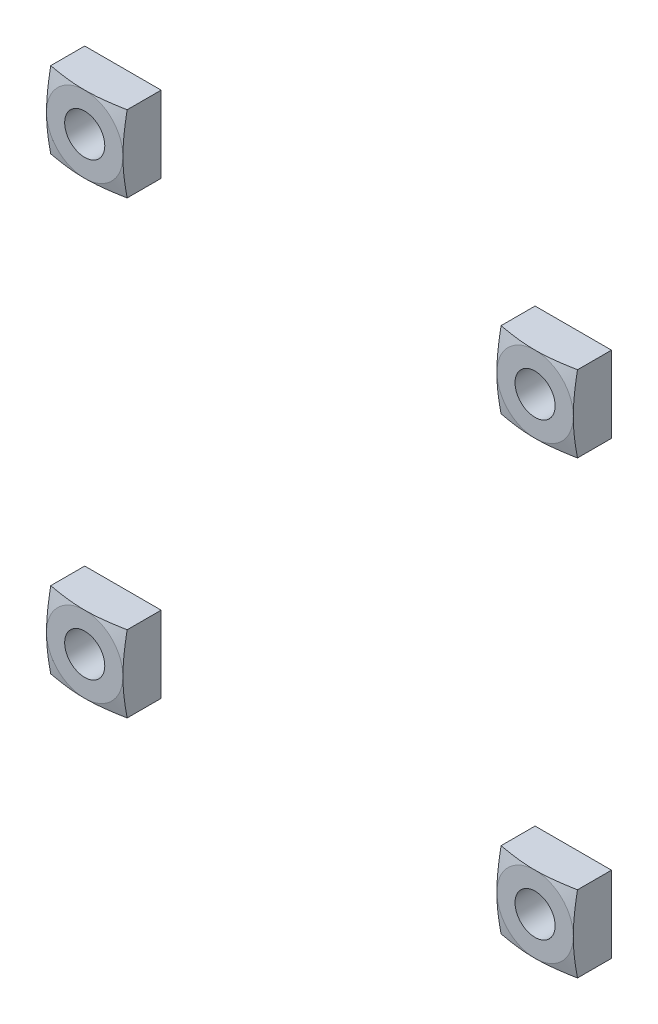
ISO-10303-21;
HEADER;
FILE_DESCRIPTION(('STEP AP214'),'2;1');
FILE_NAME('part.step','',(''),(''),'','','');
FILE_SCHEMA(('AUTOMOTIVE_DESIGN { 1 0 10303 214 1 1 1 1 }'));
ENDSEC;
DATA;
#1=APPLICATION_CONTEXT('core data for automotive mechanical design processes');
#2=APPLICATION_PROTOCOL_DEFINITION('international standard','automotive_design',2000,#1);
#3=PRODUCT_CONTEXT('',#1,'mechanical');
#4=PRODUCT('Part','Part','',(#3));
#5=PRODUCT_RELATED_PRODUCT_CATEGORY('part','',(#4));
#6=PRODUCT_DEFINITION_FORMATION('','',#4);
#7=PRODUCT_DEFINITION_CONTEXT('part definition',#1,'design');
#8=PRODUCT_DEFINITION('design','',#6,#7);
#9=PRODUCT_DEFINITION_SHAPE('','',#8);
#10=(LENGTH_UNIT() NAMED_UNIT(*) SI_UNIT(.MILLI.,.METRE.));
#11=(NAMED_UNIT(*) PLANE_ANGLE_UNIT() SI_UNIT($,.RADIAN.));
#12=(NAMED_UNIT(*) SI_UNIT($,.STERADIAN.) SOLID_ANGLE_UNIT());
#13=UNCERTAINTY_MEASURE_WITH_UNIT(LENGTH_MEASURE(1.E-05),#10,'distance_accuracy_value','');
#14=(GEOMETRIC_REPRESENTATION_CONTEXT(3) GLOBAL_UNCERTAINTY_ASSIGNED_CONTEXT((#13)) GLOBAL_UNIT_ASSIGNED_CONTEXT((#10,
#11,#12)) REPRESENTATION_CONTEXT('',''));
#15=CARTESIAN_POINT('',(0.,0.,0.));
#16=DIRECTION('',(0.,0.,1.));
#17=DIRECTION('',(1.,0.,0.));
#18=AXIS2_PLACEMENT_3D('',#15,#16,#17);
#19=CARTESIAN_POINT('',(-27.5731723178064,106.124807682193,47.0535));
#20=DIRECTION('',(0.,-1.,0.));
#21=DIRECTION('',(1.,0.,0.));
#22=AXIS2_PLACEMENT_3D('',#19,#20,#21);
#23=PLANE('',#22);
#24=DIRECTION('',(0.,0.,1.));
#25=VECTOR('',#24,1.);
#26=CARTESIAN_POINT('',(-19.5731723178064,106.124807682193,47.0535));
#27=LINE('',#26,#25);
#28=CARTESIAN_POINT('',(-19.5731723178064,106.124807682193,47.0535));
#29=VERTEX_POINT('',#28);
#30=CARTESIAN_POINT('',(-19.5731723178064,106.124807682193,50.6095472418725));
#31=VERTEX_POINT('',#30);
#32=EDGE_CURVE('P0_E153',#29,#31,#27,.T.);
#33=ORIENTED_EDGE('',*,*,#32,.T.);
#34=CARTESIAN_POINT('',(-31.6453890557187,106.124807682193,49.7113632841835));
#35=CARTESIAN_POINT('',(-31.4370613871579,106.124807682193,49.7613723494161));
#36=CARTESIAN_POINT('',(-31.2286498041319,106.124807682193,49.8110354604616));
#37=CARTESIAN_POINT('',(-30.8116155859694,106.124807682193,49.9094819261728));
#38=CARTESIAN_POINT('',(-30.6029929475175,106.124807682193,49.9582652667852));
#39=CARTESIAN_POINT('',(-30.1855506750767,106.124807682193,50.054751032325));
#40=CARTESIAN_POINT('',(-29.9767311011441,106.124807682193,50.1024537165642));
#41=CARTESIAN_POINT('',(-29.5587931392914,106.124807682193,50.1965317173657));
#42=CARTESIAN_POINT('',(-29.349674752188,106.124807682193,50.2429070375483));
#43=CARTESIAN_POINT('',(-28.9321634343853,106.124807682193,50.3337599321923));
#44=CARTESIAN_POINT('',(-28.7237723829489,106.124807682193,50.3782461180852));
#45=CARTESIAN_POINT('',(-28.3065582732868,106.124807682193,50.4651421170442));
#46=CARTESIAN_POINT('',(-28.0977352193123,106.124807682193,50.5075519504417));
#47=CARTESIAN_POINT('',(-27.6794393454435,106.124807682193,50.5897540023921));
#48=CARTESIAN_POINT('',(-27.4699662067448,106.124807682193,50.6295446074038));
#49=CARTESIAN_POINT('',(-27.050398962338,106.124807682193,50.7057398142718));
#50=CARTESIAN_POINT('',(-26.8403048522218,106.124807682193,50.7421443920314));
#51=CARTESIAN_POINT('',(-26.4167637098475,106.124807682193,50.8110518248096));
#52=CARTESIAN_POINT('',(-26.2033076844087,106.124807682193,50.8434999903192));
#53=CARTESIAN_POINT('',(-25.7756028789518,106.124807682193,50.9027547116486));
#54=CARTESIAN_POINT('',(-25.561354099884,106.124807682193,50.9295612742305));
#55=CARTESIAN_POINT('',(-25.1323622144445,106.124807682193,50.9761500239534));
#56=CARTESIAN_POINT('',(-24.9176201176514,106.124807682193,50.9959413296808));
#57=CARTESIAN_POINT('',(-24.4875283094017,106.124807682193,51.0272514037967));
#58=CARTESIAN_POINT('',(-24.2721786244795,106.124807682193,51.0387705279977));
#59=CARTESIAN_POINT('',(-23.8403017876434,106.124807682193,51.0526542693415));
#60=CARTESIAN_POINT('',(-23.6237734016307,106.124807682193,51.0549815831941));
#61=CARTESIAN_POINT('',(-23.1908233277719,106.124807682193,51.0501761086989));
#62=CARTESIAN_POINT('',(-22.97440164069,106.124807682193,51.0430432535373));
#63=CARTESIAN_POINT('',(-22.5417811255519,106.124807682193,51.0199058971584));
#64=CARTESIAN_POINT('',(-22.3255828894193,106.124807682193,51.0038906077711));
#65=CARTESIAN_POINT('',(-21.893911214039,106.124807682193,50.9641523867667));
#66=CARTESIAN_POINT('',(-21.6784377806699,106.124807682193,50.9404293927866));
#67=CARTESIAN_POINT('',(-21.1530476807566,106.124807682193,50.8747609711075));
#68=CARTESIAN_POINT('',(-20.8435630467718,106.124807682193,50.8293981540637));
#69=CARTESIAN_POINT('',(-20.2260913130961,106.124807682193,50.7293238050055));
#70=CARTESIAN_POINT('',(-19.9181045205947,106.124807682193,50.6746104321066));
#71=CARTESIAN_POINT('',(-19.3031748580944,106.124807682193,50.5586484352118));
#72=CARTESIAN_POINT('',(-18.9962327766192,106.124807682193,50.4973956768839));
#73=CARTESIAN_POINT('',(-18.3833239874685,106.124807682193,50.3703443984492));
#74=CARTESIAN_POINT('',(-18.0773572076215,106.124807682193,50.3045462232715));
#75=CARTESIAN_POINT('',(-17.4654593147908,106.124807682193,50.1695616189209));
#76=CARTESIAN_POINT('',(-17.1595298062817,106.124807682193,50.1003679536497));
#77=CARTESIAN_POINT('',(-16.5482124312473,106.124807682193,49.9596164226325));
#78=CARTESIAN_POINT('',(-16.242824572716,106.124807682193,49.8880585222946));
#79=CARTESIAN_POINT('',(-15.6325836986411,106.124807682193,49.743216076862));
#80=CARTESIAN_POINT('',(-15.3277305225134,106.124807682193,49.6699322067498));
#81=CARTESIAN_POINT('',(-14.7183474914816,106.124807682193,49.5220309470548));
#82=CARTESIAN_POINT('',(-14.4138176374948,106.124807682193,49.4474135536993));
#83=CARTESIAN_POINT('',(-13.504625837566,106.124807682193,49.2230260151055));
#84=CARTESIAN_POINT('',(-12.9003345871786,106.124807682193,49.0717550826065));
#85=CARTESIAN_POINT('',(-11.6923181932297,106.124807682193,48.7666792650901));
#86=CARTESIAN_POINT('',(-11.0885931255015,106.124807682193,48.6128740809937));
#87=CARTESIAN_POINT('',(-9.88442923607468,106.124807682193,48.3043127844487));
#88=CARTESIAN_POINT('',(-9.28398837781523,106.124807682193,48.1495646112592));
#89=CARTESIAN_POINT('',(-8.083494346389,106.124807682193,47.8388877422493));
#90=CARTESIAN_POINT('',(-7.48344113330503,106.124807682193,47.6829592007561));
#91=CARTESIAN_POINT('',(-6.88348466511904,106.124807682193,47.5266635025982));
#92=B_SPLINE_CURVE_WITH_KNOTS('',3,(#34,#35,#36,#37,#38,#39,#40,#41,#42,#43,#44,#45,#46,#47,#48,
#49,#50,#51,#52,#53,#54,#55,#56,#57,#58,#59,#60,#61,#62,#63,#64,#65,#66,#67,#68,#69,#70,#71,#72,
#73,#74,#75,#76,#77,#78,#79,#80,#81,#82,#83,#84,#85,#86,#87,#88,#89,#90,#91),.UNSPECIFIED.,.F.,
.F.,(4,2,2,2,2,2,2,2,2,2,2,2,2,2,2,2,2,2,2,2,2,2,2,2,2,2,2,2,4),(0.,0.642738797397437,
1.28548785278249,1.92808100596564,2.57067240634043,3.20992362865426,3.84916859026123,
4.4888037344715,5.12844343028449,5.77610915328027,6.42377409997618,7.07059408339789,
7.71738624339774,8.36680061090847,9.01621956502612,9.66642900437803,10.3166437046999,
11.254795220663,12.1931316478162,13.1320648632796,14.0709269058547,15.0118848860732,
15.9528566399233,16.8934663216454,17.8340786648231,19.7028801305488,21.5719037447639,
23.4320866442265,25.2920303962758),.UNSPECIFIED.);
#93=CARTESIAN_POINT('',(-23.5731723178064,106.124807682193,51.0535));
#94=VERTEX_POINT('',#93);
#95=EDGE_CURVE('P0_E95',#31,#94,#92,.F.);
#96=ORIENTED_EDGE('',*,*,#95,.T.);
#97=CARTESIAN_POINT('',(-27.5731723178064,106.124807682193,50.6095472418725));
#98=VERTEX_POINT('',#97);
#99=EDGE_CURVE('P0_E85',#94,#98,#92,.F.);
#100=ORIENTED_EDGE('',*,*,#99,.T.);
#101=DIRECTION('',(0.,0.,1.));
#102=VECTOR('',#101,1.);
#103=CARTESIAN_POINT('',(-27.5731723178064,106.124807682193,47.0535));
#104=LINE('',#103,#102);
#105=CARTESIAN_POINT('',(-27.5731723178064,106.124807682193,47.0535));
#106=VERTEX_POINT('',#105);
#107=EDGE_CURVE('P0_E89',#106,#98,#104,.T.);
#108=ORIENTED_EDGE('',*,*,#107,.F.);
#109=DIRECTION('',(1.,0.,0.));
#110=VECTOR('',#109,1.);
#111=CARTESIAN_POINT('',(-27.5731723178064,106.124807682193,47.0535));
#112=LINE('',#111,#110);
#113=EDGE_CURVE('P0_E155',#106,#29,#112,.T.);
#114=ORIENTED_EDGE('',*,*,#113,.T.);
#115=EDGE_LOOP('',(#33,#96,#100,#108,#114));
#116=FACE_BOUND('',#115,.T.);
#117=ADVANCED_FACE('P0_F16',(#116),#23,.T.);
#118=CARTESIAN_POINT('',(-27.5731723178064,114.124807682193,47.0535));
#119=DIRECTION('',(-1.,0.,0.));
#120=DIRECTION('',(0.,-1.,0.));
#121=AXIS2_PLACEMENT_3D('',#118,#119,#120);
#122=PLANE('',#121);
#123=ORIENTED_EDGE('',*,*,#107,.T.);
#124=CARTESIAN_POINT('',(-27.5731723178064,102.052590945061,49.7113632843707));
#125=CARTESIAN_POINT('',(-27.5731723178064,102.260918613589,49.7613723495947));
#126=CARTESIAN_POINT('',(-27.5731723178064,102.469330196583,49.8110354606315));
#127=CARTESIAN_POINT('',(-27.5731723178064,102.886364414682,49.9094819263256));
#128=CARTESIAN_POINT('',(-27.5731723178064,103.094987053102,49.9582652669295));
#129=CARTESIAN_POINT('',(-27.5731723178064,103.512429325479,50.0547510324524));
#130=CARTESIAN_POINT('',(-27.5731723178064,103.721248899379,50.1024537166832));
#131=CARTESIAN_POINT('',(-27.5731723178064,104.139186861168,50.196531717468));
#132=CARTESIAN_POINT('',(-27.5731723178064,104.348305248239,50.2429070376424));
#133=CARTESIAN_POINT('',(-27.5731723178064,104.765816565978,50.3337599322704));
#134=CARTESIAN_POINT('',(-27.5731723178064,104.974207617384,50.3782461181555));
#135=CARTESIAN_POINT('',(-27.5731723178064,105.391421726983,50.4651421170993));
#136=CARTESIAN_POINT('',(-27.5731723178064,105.600244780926,50.5075519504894));
#137=CARTESIAN_POINT('',(-27.5731723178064,106.018540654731,50.5897540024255));
#138=CARTESIAN_POINT('',(-27.5731723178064,106.228013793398,50.6295446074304));
#139=CARTESIAN_POINT('',(-27.5731723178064,106.647581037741,50.7057398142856));
#140=CARTESIAN_POINT('',(-27.5731723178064,106.857675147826,50.7421443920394));
#141=CARTESIAN_POINT('',(-27.5731723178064,107.281216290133,50.8110518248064));
#142=CARTESIAN_POINT('',(-27.5731723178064,107.494672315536,50.8434999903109));
#143=CARTESIAN_POINT('',(-27.5731723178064,107.922377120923,50.9027547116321));
#144=CARTESIAN_POINT('',(-27.5731723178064,108.136625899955,50.9295612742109));
#145=CARTESIAN_POINT('',(-27.5731723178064,108.565617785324,50.9761500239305));
#146=CARTESIAN_POINT('',(-27.5731723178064,108.780359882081,50.9959413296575));
#147=CARTESIAN_POINT('',(-27.5731723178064,109.21045169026,51.027251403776));
#148=CARTESIAN_POINT('',(-27.5731723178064,109.425801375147,51.0387705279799));
#149=CARTESIAN_POINT('',(-27.5731723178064,109.857678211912,51.052654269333));
#150=CARTESIAN_POINT('',(-27.5731723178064,110.074206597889,51.054981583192));
#151=CARTESIAN_POINT('',(-27.5731723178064,110.507156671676,51.0501761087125));
#152=CARTESIAN_POINT('',(-27.5731723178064,110.723578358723,51.0430432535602));
#153=CARTESIAN_POINT('',(-27.5731723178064,111.15619887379,51.019905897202));
#154=CARTESIAN_POINT('',(-27.5731723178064,111.372397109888,51.0038906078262));
#155=CARTESIAN_POINT('',(-27.5731723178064,111.804068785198,50.9641523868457));
#156=CARTESIAN_POINT('',(-27.5731723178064,112.019542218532,50.9404293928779));
#157=CARTESIAN_POINT('',(-27.5731723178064,112.544932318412,50.8747609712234));
#158=CARTESIAN_POINT('',(-27.5731723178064,112.854416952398,50.8293981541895));
#159=CARTESIAN_POINT('',(-27.5731723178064,113.471888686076,50.7293238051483));
#160=CARTESIAN_POINT('',(-27.5731723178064,113.779875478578,50.6746104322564));
#161=CARTESIAN_POINT('',(-27.5731723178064,114.39480514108,50.5586484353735));
#162=CARTESIAN_POINT('',(-27.5731723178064,114.701747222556,50.4973956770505));
#163=CARTESIAN_POINT('',(-27.5731723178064,115.314656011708,50.370344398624));
#164=CARTESIAN_POINT('',(-27.5731723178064,115.620622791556,50.3045462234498));
#165=CARTESIAN_POINT('',(-27.5731723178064,116.232520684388,50.169561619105));
#166=CARTESIAN_POINT('',(-27.5731723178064,116.538450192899,50.1003679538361));
#167=CARTESIAN_POINT('',(-27.5731723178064,117.149767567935,49.959616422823));
#168=CARTESIAN_POINT('',(-27.5731723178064,117.455155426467,49.8880585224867));
#169=CARTESIAN_POINT('',(-27.5731723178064,118.065396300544,49.743216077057));
#170=CARTESIAN_POINT('',(-27.5731723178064,118.370249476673,49.6699322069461));
#171=CARTESIAN_POINT('',(-27.5731723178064,118.979632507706,49.5220309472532));
#172=CARTESIAN_POINT('',(-27.5731723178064,119.284162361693,49.4474135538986));
#173=CARTESIAN_POINT('',(-27.5731723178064,120.193354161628,49.2230260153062));
#174=CARTESIAN_POINT('',(-27.5731723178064,120.797645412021,49.0717550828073));
#175=CARTESIAN_POINT('',(-27.5731723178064,122.005661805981,48.7666792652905));
#176=CARTESIAN_POINT('',(-27.5731723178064,122.609386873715,48.6128740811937));
#177=CARTESIAN_POINT('',(-27.5731723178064,123.81355076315,48.3043127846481));
#178=CARTESIAN_POINT('',(-27.5731723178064,124.413991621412,48.1495646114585));
#179=CARTESIAN_POINT('',(-27.5731723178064,125.614485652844,47.8388877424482));
#180=CARTESIAN_POINT('',(-27.5731723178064,126.214538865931,47.6829592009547));
#181=CARTESIAN_POINT('',(-27.5731723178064,126.81449533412,47.5266635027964));
#182=B_SPLINE_CURVE_WITH_KNOTS('',3,(#124,#125,#126,#127,#128,#129,#130,#131,#132,#133,#134,
#135,#136,#137,#138,#139,#140,#141,#142,#143,#144,#145,#146,#147,#148,#149,#150,#151,#152,#153,
#154,#155,#156,#157,#158,#159,#160,#161,#162,#163,#164,#165,#166,#167,#168,#169,#170,#171,#172,
#173,#174,#175,#176,#177,#178,#179,#180,#181),.UNSPECIFIED.,.F.,.F.,(4,2,2,2,2,2,2,2,2,2,2,2,2,
2,2,2,2,2,2,2,2,2,2,2,2,2,2,2,4),(0.,0.642738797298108,1.28548785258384,1.9280810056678,
2.57067240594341,3.20992362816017,3.84916858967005,4.48880373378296,5.12844342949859,
5.77610915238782,6.42377409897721,7.07059408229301,7.71738624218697,8.36680060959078,
9.01621956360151,9.6664290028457,10.3166437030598,11.2547952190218,12.1931316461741,
13.132064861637,14.0709269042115,15.0118848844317,15.9528566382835,16.8934663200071,
17.8340786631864,19.7028801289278,21.5719037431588,23.4320866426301,25.2920303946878),.UNSPECIFIED.);
#183=CARTESIAN_POINT('',(-27.5731723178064,110.124807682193,51.0535));
#184=VERTEX_POINT('',#183);
#185=EDGE_CURVE('P0_E78',#98,#184,#182,.T.);
#186=ORIENTED_EDGE('',*,*,#185,.T.);
#187=CARTESIAN_POINT('',(-27.5731723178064,114.124807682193,50.6095472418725));
#188=VERTEX_POINT('',#187);
#189=EDGE_CURVE('P0_E68',#184,#188,#182,.T.);
#190=ORIENTED_EDGE('',*,*,#189,.T.);
#191=DIRECTION('',(0.,0.,1.));
#192=VECTOR('',#191,1.);
#193=CARTESIAN_POINT('',(-27.5731723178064,114.124807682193,47.0535));
#194=LINE('',#193,#192);
#195=CARTESIAN_POINT('',(-27.5731723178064,114.124807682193,47.0535));
#196=VERTEX_POINT('',#195);
#197=EDGE_CURVE('P0_E161',#196,#188,#194,.T.);
#198=ORIENTED_EDGE('',*,*,#197,.F.);
#199=DIRECTION('',(0.,-1.,0.));
#200=VECTOR('',#199,1.);
#201=CARTESIAN_POINT('',(-27.5731723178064,114.124807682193,47.0535));
#202=LINE('',#201,#200);
#203=EDGE_CURVE('P0_E159',#196,#106,#202,.T.);
#204=ORIENTED_EDGE('',*,*,#203,.T.);
#205=EDGE_LOOP('',(#123,#186,#190,#198,#204));
#206=FACE_BOUND('',#205,.T.);
#207=ADVANCED_FACE('P0_F93',(#206),#122,.T.);
#208=CARTESIAN_POINT('',(-19.5731723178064,114.124807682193,47.0535));
#209=DIRECTION('',(0.,1.,0.));
#210=DIRECTION('',(-1.,0.,0.));
#211=AXIS2_PLACEMENT_3D('',#208,#209,#210);
#212=PLANE('',#211);
#213=ORIENTED_EDGE('',*,*,#197,.T.);
#214=CARTESIAN_POINT('',(-31.6453890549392,114.124807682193,49.7113632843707));
#215=CARTESIAN_POINT('',(-31.4370613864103,114.124807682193,49.7613723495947));
#216=CARTESIAN_POINT('',(-31.2286498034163,114.124807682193,49.8110354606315));
#217=CARTESIAN_POINT('',(-30.8116155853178,114.124807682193,49.9094819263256));
#218=CARTESIAN_POINT('',(-30.6029929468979,114.124807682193,49.9582652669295));
#219=CARTESIAN_POINT('',(-30.1855506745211,114.124807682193,50.0547510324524));
#220=CARTESIAN_POINT('',(-29.9767311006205,114.124807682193,50.1024537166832));
#221=CARTESIAN_POINT('',(-29.5587931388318,114.124807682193,50.1965317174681));
#222=CARTESIAN_POINT('',(-29.3496747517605,114.124807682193,50.2429070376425));
#223=CARTESIAN_POINT('',(-28.9321634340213,114.124807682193,50.3337599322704));
#224=CARTESIAN_POINT('',(-28.7237723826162,114.124807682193,50.3782461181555));
#225=CARTESIAN_POINT('',(-28.3065582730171,114.124807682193,50.4651421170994));
#226=CARTESIAN_POINT('',(-28.0977352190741,114.124807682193,50.5075519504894));
#227=CARTESIAN_POINT('',(-27.6794393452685,114.124807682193,50.5897540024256));
#228=CARTESIAN_POINT('',(-27.4699662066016,114.124807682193,50.6295446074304));
#229=CARTESIAN_POINT('',(-27.0503989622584,114.124807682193,50.7057398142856));
#230=CARTESIAN_POINT('',(-26.8403048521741,114.124807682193,50.7421443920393));
#231=CARTESIAN_POINT('',(-26.4167637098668,114.124807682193,50.8110518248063));
#232=CARTESIAN_POINT('',(-26.2033076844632,114.124807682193,50.8434999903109));
#233=CARTESIAN_POINT('',(-25.7756028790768,114.124807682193,50.9027547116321));
#234=CARTESIAN_POINT('',(-25.5613541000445,114.124807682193,50.9295612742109));
#235=CARTESIAN_POINT('',(-25.1323622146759,114.124807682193,50.9761500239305));
#236=CARTESIAN_POINT('',(-24.9176201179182,114.124807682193,50.9959413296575));
#237=CARTESIAN_POINT('',(-24.4875283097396,114.124807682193,51.027251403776));
#238=CARTESIAN_POINT('',(-24.2721786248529,114.124807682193,51.0387705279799));
#239=CARTESIAN_POINT('',(-23.8403017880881,114.124807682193,51.052654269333));
#240=CARTESIAN_POINT('',(-23.6237734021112,114.124807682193,51.054981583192));
#241=CARTESIAN_POINT('',(-23.1908233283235,114.124807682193,51.0501761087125));
#242=CARTESIAN_POINT('',(-22.974401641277,114.124807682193,51.0430432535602));
#243=CARTESIAN_POINT('',(-22.5417811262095,114.124807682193,51.019905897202));
#244=CARTESIAN_POINT('',(-22.3255828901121,114.124807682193,51.0038906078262));
#245=CARTESIAN_POINT('',(-21.8939112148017,114.124807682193,50.9641523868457));
#246=CARTESIAN_POINT('',(-21.6784377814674,114.124807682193,50.9404293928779));
#247=CARTESIAN_POINT('',(-21.1530476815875,114.124807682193,50.8747609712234));
#248=CARTESIAN_POINT('',(-20.8435630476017,114.124807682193,50.8293981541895));
#249=CARTESIAN_POINT('',(-20.2260913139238,114.124807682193,50.7293238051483));
#250=CARTESIAN_POINT('',(-19.9181045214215,114.124807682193,50.6746104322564));
#251=CARTESIAN_POINT('',(-19.3031748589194,114.124807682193,50.5586484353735));
#252=CARTESIAN_POINT('',(-18.9962327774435,114.124807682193,50.4973956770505));
#253=CARTESIAN_POINT('',(-18.3833239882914,114.124807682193,50.370344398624));
#254=CARTESIAN_POINT('',(-18.0773572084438,114.124807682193,50.3045462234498));
#255=CARTESIAN_POINT('',(-17.4654593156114,114.124807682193,50.169561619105));
#256=CARTESIAN_POINT('',(-17.1595298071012,114.124807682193,50.1003679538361));
#257=CARTESIAN_POINT('',(-16.5482124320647,114.124807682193,49.959616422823));
#258=CARTESIAN_POINT('',(-16.2428245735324,114.124807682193,49.8880585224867));
#259=CARTESIAN_POINT('',(-15.6325836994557,114.124807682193,49.7432160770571));
#260=CARTESIAN_POINT('',(-15.3277305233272,114.124807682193,49.6699322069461));
#261=CARTESIAN_POINT('',(-14.7183474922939,114.124807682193,49.5220309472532));
#262=CARTESIAN_POINT('',(-14.4138176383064,114.124807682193,49.4474135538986));
#263=CARTESIAN_POINT('',(-13.5046258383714,114.124807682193,49.2230260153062));
#264=CARTESIAN_POINT('',(-12.9003345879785,114.124807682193,49.0717550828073));
#265=CARTESIAN_POINT('',(-11.6923181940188,114.124807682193,48.7666792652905));
#266=CARTESIAN_POINT('',(-11.0885931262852,114.124807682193,48.6128740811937));
#267=CARTESIAN_POINT('',(-9.88442923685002,114.124807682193,48.3043127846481));
#268=CARTESIAN_POINT('',(-9.28398837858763,114.124807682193,48.1495646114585));
#269=CARTESIAN_POINT('',(-8.08349434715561,114.124807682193,47.8388877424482));
#270=CARTESIAN_POINT('',(-7.48344113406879,114.124807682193,47.6829592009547));
#271=CARTESIAN_POINT('',(-6.88348466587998,114.124807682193,47.5266635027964));
#272=B_SPLINE_CURVE_WITH_KNOTS('',3,(#214,#215,#216,#217,#218,#219,#220,#221,#222,#223,#224,
#225,#226,#227,#228,#229,#230,#231,#232,#233,#234,#235,#236,#237,#238,#239,#240,#241,#242,#243,
#244,#245,#246,#247,#248,#249,#250,#251,#252,#253,#254,#255,#256,#257,#258,#259,#260,#261,#262,
#263,#264,#265,#266,#267,#268,#269,#270,#271),.UNSPECIFIED.,.F.,.F.,(4,2,2,2,2,2,2,2,2,2,2,2,2,
2,2,2,2,2,2,2,2,2,2,2,2,2,2,2,4),(0.,0.642738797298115,1.28548785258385,1.92808100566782,
2.57067240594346,3.20992362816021,3.8491685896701,4.48880373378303,5.12844342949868,
5.77610915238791,6.42377409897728,7.07059408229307,7.71738624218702,8.36680060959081,
9.0162195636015,9.66642900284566,10.3166437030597,11.2547952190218,12.193131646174,
13.1320648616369,14.0709269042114,15.0118848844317,15.9528566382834,16.893466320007,
17.8340786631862,19.7028801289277,21.5719037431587,23.4320866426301,25.2920303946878),.UNSPECIFIED.);
#273=CARTESIAN_POINT('',(-23.5731723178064,114.124807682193,51.0535));
#274=VERTEX_POINT('',#273);
#275=EDGE_CURVE('P0_E74',#188,#274,#272,.T.);
#276=ORIENTED_EDGE('',*,*,#275,.T.);
#277=CARTESIAN_POINT('',(-19.5731723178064,114.124807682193,50.6095472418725));
#278=VERTEX_POINT('',#277);
#279=EDGE_CURVE('P0_E32',#274,#278,#272,.T.);
#280=ORIENTED_EDGE('',*,*,#279,.T.);
#281=DIRECTION('',(0.,0.,1.));
#282=VECTOR('',#281,1.);
#283=CARTESIAN_POINT('',(-19.5731723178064,114.124807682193,47.0535));
#284=LINE('',#283,#282);
#285=CARTESIAN_POINT('',(-19.5731723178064,114.124807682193,47.0535));
#286=VERTEX_POINT('',#285);
#287=EDGE_CURVE('P0_E158',#286,#278,#284,.T.);
#288=ORIENTED_EDGE('',*,*,#287,.F.);
#289=DIRECTION('',(-1.,0.,0.));
#290=VECTOR('',#289,1.);
#291=CARTESIAN_POINT('',(-19.5731723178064,114.124807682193,47.0535));
#292=LINE('',#291,#290);
#293=EDGE_CURVE('P0_E163',#286,#196,#292,.T.);
#294=ORIENTED_EDGE('',*,*,#293,.T.);
#295=EDGE_LOOP('',(#213,#276,#280,#288,#294));
#296=FACE_BOUND('',#295,.T.);
#297=ADVANCED_FACE('P0_F136',(#296),#212,.T.);
#298=CARTESIAN_POINT('',(-19.5731723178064,106.124807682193,47.0535));
#299=DIRECTION('',(1.,0.,0.));
#300=DIRECTION('',(0.,1.,0.));
#301=AXIS2_PLACEMENT_3D('',#298,#299,#300);
#302=PLANE('',#301);
#303=ORIENTED_EDGE('',*,*,#287,.T.);
#304=CARTESIAN_POINT('',(-19.5731723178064,102.052590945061,49.7113632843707));
#305=CARTESIAN_POINT('',(-19.5731723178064,102.260918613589,49.7613723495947));
#306=CARTESIAN_POINT('',(-19.5731723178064,102.469330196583,49.8110354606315));
#307=CARTESIAN_POINT('',(-19.5731723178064,102.886364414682,49.9094819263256));
#308=CARTESIAN_POINT('',(-19.5731723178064,103.094987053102,49.9582652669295));
#309=CARTESIAN_POINT('',(-19.5731723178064,103.512429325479,50.0547510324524));
#310=CARTESIAN_POINT('',(-19.5731723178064,103.721248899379,50.1024537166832));
#311=CARTESIAN_POINT('',(-19.5731723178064,104.139186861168,50.196531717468));
#312=CARTESIAN_POINT('',(-19.5731723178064,104.348305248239,50.2429070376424));
#313=CARTESIAN_POINT('',(-19.5731723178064,104.765816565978,50.3337599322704));
#314=CARTESIAN_POINT('',(-19.5731723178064,104.974207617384,50.3782461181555));
#315=CARTESIAN_POINT('',(-19.5731723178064,105.391421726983,50.4651421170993));
#316=CARTESIAN_POINT('',(-19.5731723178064,105.600244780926,50.5075519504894));
#317=CARTESIAN_POINT('',(-19.5731723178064,106.018540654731,50.5897540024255));
#318=CARTESIAN_POINT('',(-19.5731723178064,106.228013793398,50.6295446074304));
#319=CARTESIAN_POINT('',(-19.5731723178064,106.647581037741,50.7057398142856));
#320=CARTESIAN_POINT('',(-19.5731723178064,106.857675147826,50.7421443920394));
#321=CARTESIAN_POINT('',(-19.5731723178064,107.281216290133,50.8110518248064));
#322=CARTESIAN_POINT('',(-19.5731723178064,107.494672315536,50.8434999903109));
#323=CARTESIAN_POINT('',(-19.5731723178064,107.922377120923,50.9027547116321));
#324=CARTESIAN_POINT('',(-19.5731723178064,108.136625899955,50.9295612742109));
#325=CARTESIAN_POINT('',(-19.5731723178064,108.565617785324,50.9761500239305));
#326=CARTESIAN_POINT('',(-19.5731723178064,108.780359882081,50.9959413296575));
#327=CARTESIAN_POINT('',(-19.5731723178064,109.21045169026,51.027251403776));
#328=CARTESIAN_POINT('',(-19.5731723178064,109.425801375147,51.0387705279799));
#329=CARTESIAN_POINT('',(-19.5731723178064,109.857678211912,51.052654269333));
#330=CARTESIAN_POINT('',(-19.5731723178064,110.074206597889,51.054981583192));
#331=CARTESIAN_POINT('',(-19.5731723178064,110.507156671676,51.0501761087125));
#332=CARTESIAN_POINT('',(-19.5731723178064,110.723578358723,51.0430432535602));
#333=CARTESIAN_POINT('',(-19.5731723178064,111.15619887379,51.019905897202));
#334=CARTESIAN_POINT('',(-19.5731723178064,111.372397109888,51.0038906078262));
#335=CARTESIAN_POINT('',(-19.5731723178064,111.804068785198,50.9641523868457));
#336=CARTESIAN_POINT('',(-19.5731723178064,112.019542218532,50.9404293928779));
#337=CARTESIAN_POINT('',(-19.5731723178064,112.544932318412,50.8747609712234));
#338=CARTESIAN_POINT('',(-19.5731723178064,112.854416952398,50.8293981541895));
#339=CARTESIAN_POINT('',(-19.5731723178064,113.471888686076,50.7293238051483));
#340=CARTESIAN_POINT('',(-19.5731723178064,113.779875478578,50.6746104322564));
#341=CARTESIAN_POINT('',(-19.5731723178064,114.39480514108,50.5586484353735));
#342=CARTESIAN_POINT('',(-19.5731723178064,114.701747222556,50.4973956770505));
#343=CARTESIAN_POINT('',(-19.5731723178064,115.314656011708,50.370344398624));
#344=CARTESIAN_POINT('',(-19.5731723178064,115.620622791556,50.3045462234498));
#345=CARTESIAN_POINT('',(-19.5731723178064,116.232520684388,50.169561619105));
#346=CARTESIAN_POINT('',(-19.5731723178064,116.538450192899,50.1003679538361));
#347=CARTESIAN_POINT('',(-19.5731723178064,117.149767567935,49.959616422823));
#348=CARTESIAN_POINT('',(-19.5731723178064,117.455155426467,49.8880585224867));
#349=CARTESIAN_POINT('',(-19.5731723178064,118.065396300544,49.743216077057));
#350=CARTESIAN_POINT('',(-19.5731723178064,118.370249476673,49.6699322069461));
#351=CARTESIAN_POINT('',(-19.5731723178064,118.979632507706,49.5220309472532));
#352=CARTESIAN_POINT('',(-19.5731723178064,119.284162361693,49.4474135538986));
#353=CARTESIAN_POINT('',(-19.5731723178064,120.193354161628,49.2230260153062));
#354=CARTESIAN_POINT('',(-19.5731723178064,120.797645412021,49.0717550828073));
#355=CARTESIAN_POINT('',(-19.5731723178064,122.005661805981,48.7666792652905));
#356=CARTESIAN_POINT('',(-19.5731723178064,122.609386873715,48.6128740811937));
#357=CARTESIAN_POINT('',(-19.5731723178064,123.81355076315,48.3043127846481));
#358=CARTESIAN_POINT('',(-19.5731723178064,124.413991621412,48.1495646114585));
#359=CARTESIAN_POINT('',(-19.5731723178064,125.614485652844,47.8388877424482));
#360=CARTESIAN_POINT('',(-19.5731723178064,126.214538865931,47.6829592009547));
#361=CARTESIAN_POINT('',(-19.5731723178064,126.81449533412,47.5266635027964));
#362=B_SPLINE_CURVE_WITH_KNOTS('',3,(#304,#305,#306,#307,#308,#309,#310,#311,#312,#313,#314,
#315,#316,#317,#318,#319,#320,#321,#322,#323,#324,#325,#326,#327,#328,#329,#330,#331,#332,#333,
#334,#335,#336,#337,#338,#339,#340,#341,#342,#343,#344,#345,#346,#347,#348,#349,#350,#351,#352,
#353,#354,#355,#356,#357,#358,#359,#360,#361),.UNSPECIFIED.,.F.,.F.,(4,2,2,2,2,2,2,2,2,2,2,2,2,
2,2,2,2,2,2,2,2,2,2,2,2,2,2,2,4),(0.,0.642738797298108,1.28548785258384,1.9280810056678,
2.57067240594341,3.20992362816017,3.84916858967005,4.48880373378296,5.12844342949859,
5.77610915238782,6.42377409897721,7.07059408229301,7.71738624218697,8.36680060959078,
9.01621956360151,9.6664290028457,10.3166437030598,11.2547952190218,12.1931316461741,
13.132064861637,14.0709269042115,15.0118848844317,15.9528566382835,16.8934663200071,
17.8340786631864,19.7028801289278,21.5719037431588,23.4320866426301,25.2920303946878),.UNSPECIFIED.);
#363=CARTESIAN_POINT('',(-19.5731723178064,110.124807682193,51.0535));
#364=VERTEX_POINT('',#363);
#365=EDGE_CURVE('P0_E132',#278,#364,#362,.F.);
#366=ORIENTED_EDGE('',*,*,#365,.T.);
#367=EDGE_CURVE('P0_E39',#364,#31,#362,.F.);
#368=ORIENTED_EDGE('',*,*,#367,.T.);
#369=ORIENTED_EDGE('',*,*,#32,.F.);
#370=DIRECTION('',(0.,1.,0.));
#371=VECTOR('',#370,1.);
#372=CARTESIAN_POINT('',(-19.5731723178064,106.124807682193,47.0535));
#373=LINE('',#372,#371);
#374=EDGE_CURVE('P0_E170',#29,#286,#373,.T.);
#375=ORIENTED_EDGE('',*,*,#374,.T.);
#376=EDGE_LOOP('',(#303,#366,#368,#369,#375));
#377=FACE_BOUND('',#376,.T.);
#378=ADVANCED_FACE('P0_F133',(#377),#302,.T.);
#379=CARTESIAN_POINT('',(-27.5731723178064,106.124807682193,51.0535));
#380=DIRECTION('',(0.,0.,-1.));
#381=DIRECTION('',(-1.,0.,0.));
#382=AXIS2_PLACEMENT_3D('',#379,#380,#381);
#383=PLANE('',#382);
#384=CARTESIAN_POINT('',(-23.5731723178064,110.124807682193,51.0535));
#385=DIRECTION('',(0.,0.,1.));
#386=DIRECTION('',(1.,0.,0.));
#387=AXIS2_PLACEMENT_3D('',#384,#385,#386);
#388=CIRCLE('',#387,2.1);
#389=CARTESIAN_POINT('',(-21.4731723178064,110.124807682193,51.0535));
#390=VERTEX_POINT('',#389);
#391=EDGE_CURVE('P0_E174',#390,#390,#388,.T.);
#392=ORIENTED_EDGE('',*,*,#391,.F.);
#393=EDGE_LOOP('',(#392));
#394=FACE_BOUND('',#393,.T.);
#395=CARTESIAN_POINT('',(-23.5731723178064,110.124807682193,51.0535));
#396=DIRECTION('',(0.,0.,-1.));
#397=DIRECTION('',(-1.,0.,0.));
#398=AXIS2_PLACEMENT_3D('',#395,#396,#397);
#399=CIRCLE('',#398,4.);
#400=EDGE_CURVE('P0_E10',#184,#274,#399,.T.);
#401=ORIENTED_EDGE('',*,*,#400,.F.);
#402=EDGE_CURVE('P0_E20',#94,#184,#399,.T.);
#403=ORIENTED_EDGE('',*,*,#402,.F.);
#404=EDGE_CURVE('P0_E25',#364,#94,#399,.T.);
#405=ORIENTED_EDGE('',*,*,#404,.F.);
#406=CARTESIAN_POINT('',(-23.5731723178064,110.124807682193,51.0535));
#407=DIRECTION('',(0.,0.,1.));
#408=DIRECTION('',(1.,0.,0.));
#409=AXIS2_PLACEMENT_3D('',#406,#407,#408);
#410=CIRCLE('',#409,4.);
#411=EDGE_CURVE('P0_E91',#364,#274,#410,.T.);
#412=ORIENTED_EDGE('',*,*,#411,.T.);
#413=EDGE_LOOP('',(#401,#403,#405,#412));
#414=FACE_BOUND('',#413,.T.);
#415=ADVANCED_FACE('P0_F90',(#394,#414),#383,.F.);
#416=CARTESIAN_POINT('',(-27.5731723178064,106.124807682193,47.0535));
#417=DIRECTION('',(0.,0.,-1.));
#418=DIRECTION('',(-1.,0.,0.));
#419=AXIS2_PLACEMENT_3D('',#416,#417,#418);
#420=PLANE('',#419);
#421=CARTESIAN_POINT('',(-23.5731723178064,110.124807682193,47.0535));
#422=DIRECTION('',(0.,0.,1.));
#423=DIRECTION('',(1.,0.,0.));
#424=AXIS2_PLACEMENT_3D('',#421,#422,#423);
#425=CIRCLE('',#424,2.1);
#426=CARTESIAN_POINT('',(-21.4731723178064,110.124807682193,47.0535));
#427=VERTEX_POINT('',#426);
#428=EDGE_CURVE('P0_E173',#427,#427,#425,.T.);
#429=ORIENTED_EDGE('',*,*,#428,.T.);
#430=EDGE_LOOP('',(#429));
#431=FACE_BOUND('',#430,.T.);
#432=ORIENTED_EDGE('',*,*,#113,.F.);
#433=ORIENTED_EDGE('',*,*,#203,.F.);
#434=ORIENTED_EDGE('',*,*,#293,.F.);
#435=ORIENTED_EDGE('',*,*,#374,.F.);
#436=EDGE_LOOP('',(#432,#433,#434,#435));
#437=FACE_BOUND('',#436,.T.);
#438=ADVANCED_FACE('P0_F179',(#431,#437),#420,.T.);
#439=CARTESIAN_POINT('',(-23.5731723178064,110.124807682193,47.0535));
#440=DIRECTION('',(0.,0.,1.));
#441=DIRECTION('',(1.,0.,0.));
#442=AXIS2_PLACEMENT_3D('',#439,#440,#441);
#443=CYLINDRICAL_SURFACE('',#442,2.1);
#444=ORIENTED_EDGE('',*,*,#428,.F.);
#445=EDGE_LOOP('',(#444));
#446=FACE_BOUND('',#445,.T.);
#447=ORIENTED_EDGE('',*,*,#391,.T.);
#448=EDGE_LOOP('',(#447));
#449=FACE_BOUND('',#448,.T.);
#450=ADVANCED_FACE('P0_F122',(#446,#449),#443,.F.);
#451=CARTESIAN_POINT('',(-23.5731723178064,110.124807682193,51.0535));
#452=DIRECTION('',(0.,0.,-1.));
#453=DIRECTION('',(-1.,0.,0.));
#454=AXIS2_PLACEMENT_3D('',#451,#452,#453);
#455=CONICAL_SURFACE('',#454,4.,1.30899693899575);
#456=ORIENTED_EDGE('',*,*,#402,.T.);
#457=ORIENTED_EDGE('',*,*,#185,.F.);
#458=ORIENTED_EDGE('',*,*,#99,.F.);
#459=EDGE_LOOP('',(#456,#457,#458));
#460=FACE_BOUND('',#459,.T.);
#461=ADVANCED_FACE('P0_F83',(#460),#455,.T.);
#462=ORIENTED_EDGE('',*,*,#367,.F.);
#463=ORIENTED_EDGE('',*,*,#404,.T.);
#464=ORIENTED_EDGE('',*,*,#95,.F.);
#465=EDGE_LOOP('',(#462,#463,#464));
#466=FACE_BOUND('',#465,.T.);
#467=ADVANCED_FACE('P0_F121',(#466),#455,.T.);
#468=ORIENTED_EDGE('',*,*,#411,.F.);
#469=ORIENTED_EDGE('',*,*,#365,.F.);
#470=ORIENTED_EDGE('',*,*,#279,.F.);
#471=EDGE_LOOP('',(#468,#469,#470));
#472=FACE_BOUND('',#471,.T.);
#473=ADVANCED_FACE('P0_F117',(#472),#455,.T.);
#474=ORIENTED_EDGE('',*,*,#400,.T.);
#475=ORIENTED_EDGE('',*,*,#275,.F.);
#476=ORIENTED_EDGE('',*,*,#189,.F.);
#477=EDGE_LOOP('',(#474,#475,#476));
#478=FACE_BOUND('',#477,.T.);
#479=ADVANCED_FACE('P0_F70',(#478),#455,.T.);
#480=CLOSED_SHELL('',(#117,#207,#297,#378,#415,#438,#450,#461,#467,#473,#479));
#481=MANIFOLD_SOLID_BREP('P0_B1',#480);
#482=CARTESIAN_POINT('',(19.5731723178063,153.271152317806,47.0535));
#483=DIRECTION('',(0.,-1.,0.));
#484=DIRECTION('',(1.,0.,0.));
#485=AXIS2_PLACEMENT_3D('',#482,#483,#484);
#486=PLANE('',#485);
#487=DIRECTION('',(0.,0.,1.));
#488=VECTOR('',#487,1.);
#489=CARTESIAN_POINT('',(27.5731723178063,153.271152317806,47.0535));
#490=LINE('',#489,#488);
#491=CARTESIAN_POINT('',(27.5731723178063,153.271152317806,47.0535));
#492=VERTEX_POINT('',#491);
#493=CARTESIAN_POINT('',(27.5731723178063,153.271152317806,50.6095472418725));
#494=VERTEX_POINT('',#493);
#495=EDGE_CURVE('P1_E170',#492,#494,#490,.T.);
#496=ORIENTED_EDGE('',*,*,#495,.T.);
#497=CARTESIAN_POINT('',(15.5009555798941,153.271152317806,49.7113632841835));
#498=CARTESIAN_POINT('',(15.7092832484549,153.271152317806,49.7613723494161));
#499=CARTESIAN_POINT('',(15.9176948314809,153.271152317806,49.8110354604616));
#500=CARTESIAN_POINT('',(16.3347290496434,153.271152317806,49.9094819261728));
#501=CARTESIAN_POINT('',(16.5433516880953,153.271152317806,49.9582652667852));
#502=CARTESIAN_POINT('',(16.9607939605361,153.271152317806,50.054751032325));
#503=CARTESIAN_POINT('',(17.1696135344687,153.271152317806,50.1024537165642));
#504=CARTESIAN_POINT('',(17.5875514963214,153.271152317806,50.1965317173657));
#505=CARTESIAN_POINT('',(17.7966698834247,153.271152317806,50.2429070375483));
#506=CARTESIAN_POINT('',(18.2141812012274,153.271152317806,50.3337599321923));
#507=CARTESIAN_POINT('',(18.4225722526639,153.271152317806,50.3782461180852));
#508=CARTESIAN_POINT('',(18.8397863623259,153.271152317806,50.4651421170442));
#509=CARTESIAN_POINT('',(19.0486094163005,153.271152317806,50.5075519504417));
#510=CARTESIAN_POINT('',(19.4669052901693,153.271152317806,50.5897540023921));
#511=CARTESIAN_POINT('',(19.676378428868,153.271152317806,50.6295446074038));
#512=CARTESIAN_POINT('',(20.0959456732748,153.271152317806,50.7057398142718));
#513=CARTESIAN_POINT('',(20.306039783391,153.271152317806,50.7421443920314));
#514=CARTESIAN_POINT('',(20.7295809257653,153.271152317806,50.8110518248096));
#515=CARTESIAN_POINT('',(20.9430369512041,153.271152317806,50.8434999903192));
#516=CARTESIAN_POINT('',(21.370741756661,153.271152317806,50.9027547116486));
#517=CARTESIAN_POINT('',(21.5849905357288,153.271152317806,50.9295612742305));
#518=CARTESIAN_POINT('',(22.0139824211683,153.271152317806,50.9761500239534));
#519=CARTESIAN_POINT('',(22.2287245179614,153.271152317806,50.9959413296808));
#520=CARTESIAN_POINT('',(22.6588163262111,153.271152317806,51.0272514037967));
#521=CARTESIAN_POINT('',(22.8741660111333,153.271152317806,51.0387705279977));
#522=CARTESIAN_POINT('',(23.3060428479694,153.271152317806,51.0526542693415));
#523=CARTESIAN_POINT('',(23.522571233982,153.271152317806,51.0549815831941));
#524=CARTESIAN_POINT('',(23.9555213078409,153.271152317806,51.0501761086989));
#525=CARTESIAN_POINT('',(24.1719429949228,153.271152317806,51.0430432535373));
#526=CARTESIAN_POINT('',(24.6045635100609,153.271152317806,51.0199058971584));
#527=CARTESIAN_POINT('',(24.8207617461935,153.271152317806,51.0038906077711));
#528=CARTESIAN_POINT('',(25.2524334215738,153.271152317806,50.9641523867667));
#529=CARTESIAN_POINT('',(25.4679068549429,153.271152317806,50.9404293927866));
#530=CARTESIAN_POINT('',(25.9932969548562,153.271152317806,50.8747609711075));
#531=CARTESIAN_POINT('',(26.302781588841,153.271152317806,50.8293981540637));
#532=CARTESIAN_POINT('',(26.9202533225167,153.271152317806,50.7293238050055));
#533=CARTESIAN_POINT('',(27.228240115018,153.271152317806,50.6746104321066));
#534=CARTESIAN_POINT('',(27.8431697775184,153.271152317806,50.5586484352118));
#535=CARTESIAN_POINT('',(28.1501118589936,153.271152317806,50.4973956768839));
#536=CARTESIAN_POINT('',(28.7630206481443,153.271152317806,50.3703443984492));
#537=CARTESIAN_POINT('',(29.0689874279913,153.271152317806,50.3045462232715));
#538=CARTESIAN_POINT('',(29.6808853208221,153.271152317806,50.1695616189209));
#539=CARTESIAN_POINT('',(29.9868148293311,153.271152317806,50.1003679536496));
#540=CARTESIAN_POINT('',(30.5981322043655,153.271152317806,49.9596164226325));
#541=CARTESIAN_POINT('',(30.9035200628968,153.271152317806,49.8880585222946));
#542=CARTESIAN_POINT('',(31.5137609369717,153.271152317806,49.743216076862));
#543=CARTESIAN_POINT('',(31.8186141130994,153.271152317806,49.6699322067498));
#544=CARTESIAN_POINT('',(32.4279971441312,153.271152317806,49.5220309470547));
#545=CARTESIAN_POINT('',(32.732526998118,153.271152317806,49.4474135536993));
#546=CARTESIAN_POINT('',(33.6417187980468,153.271152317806,49.2230260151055));
#547=CARTESIAN_POINT('',(34.2460100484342,153.271152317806,49.0717550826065));
#548=CARTESIAN_POINT('',(35.4540264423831,153.271152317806,48.7666792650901));
#549=CARTESIAN_POINT('',(36.0577515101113,153.271152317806,48.6128740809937));
#550=CARTESIAN_POINT('',(37.2619153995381,153.271152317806,48.3043127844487));
#551=CARTESIAN_POINT('',(37.8623562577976,153.271152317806,48.1495646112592));
#552=CARTESIAN_POINT('',(39.0628502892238,153.271152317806,47.8388877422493));
#553=CARTESIAN_POINT('',(39.6629035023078,153.271152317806,47.6829592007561));
#554=CARTESIAN_POINT('',(40.2628599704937,153.271152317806,47.5266635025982));
#555=B_SPLINE_CURVE_WITH_KNOTS('',3,(#497,#498,#499,#500,#501,#502,#503,#504,#505,#506,#507,
#508,#509,#510,#511,#512,#513,#514,#515,#516,#517,#518,#519,#520,#521,#522,#523,#524,#525,#526,
#527,#528,#529,#530,#531,#532,#533,#534,#535,#536,#537,#538,#539,#540,#541,#542,#543,#544,#545,
#546,#547,#548,#549,#550,#551,#552,#553,#554),.UNSPECIFIED.,.F.,.F.,(4,2,2,2,2,2,2,2,2,2,2,2,2,
2,2,2,2,2,2,2,2,2,2,2,2,2,2,2,4),(0.,0.642738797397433,1.2854878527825,1.92808100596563,
2.57067240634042,3.20992362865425,3.84916859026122,4.48880373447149,5.12844343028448,
5.77610915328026,6.42377409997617,7.07059408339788,7.71738624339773,8.36680061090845,
9.01621956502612,9.66642900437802,10.3166437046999,11.254795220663,12.1931316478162,
13.1320648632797,14.0709269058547,15.0118848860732,15.9528566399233,16.8934663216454,
17.8340786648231,19.7028801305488,21.5719037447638,23.4320866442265,25.2920303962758),.UNSPECIFIED.);
#556=CARTESIAN_POINT('',(23.5731723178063,153.271152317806,51.0535));
#557=VERTEX_POINT('',#556);
#558=EDGE_CURVE('P1_E152',#494,#557,#555,.F.);
#559=ORIENTED_EDGE('',*,*,#558,.T.);
#560=CARTESIAN_POINT('',(19.5731723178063,153.271152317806,50.6095472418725));
#561=VERTEX_POINT('',#560);
#562=EDGE_CURVE('P1_E145',#557,#561,#555,.F.);
#563=ORIENTED_EDGE('',*,*,#562,.T.);
#564=DIRECTION('',(0.,0.,1.));
#565=VECTOR('',#564,1.);
#566=CARTESIAN_POINT('',(19.5731723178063,153.271152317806,47.0535));
#567=LINE('',#566,#565);
#568=CARTESIAN_POINT('',(19.5731723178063,153.271152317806,47.0535));
#569=VERTEX_POINT('',#568);
#570=EDGE_CURVE('P1_E171',#569,#561,#567,.T.);
#571=ORIENTED_EDGE('',*,*,#570,.F.);
#572=DIRECTION('',(1.,0.,0.));
#573=VECTOR('',#572,1.);
#574=CARTESIAN_POINT('',(19.5731723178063,153.271152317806,47.0535));
#575=LINE('',#574,#573);
#576=EDGE_CURVE('P1_E157',#569,#492,#575,.T.);
#577=ORIENTED_EDGE('',*,*,#576,.T.);
#578=EDGE_LOOP('',(#496,#559,#563,#571,#577));
#579=FACE_BOUND('',#578,.T.);
#580=ADVANCED_FACE('P1_F17',(#579),#486,.T.);
#581=CARTESIAN_POINT('',(19.5731723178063,161.271152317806,47.0535));
#582=DIRECTION('',(-1.,0.,0.));
#583=DIRECTION('',(0.,-1.,0.));
#584=AXIS2_PLACEMENT_3D('',#581,#582,#583);
#585=PLANE('',#584);
#586=ORIENTED_EDGE('',*,*,#570,.T.);
#587=CARTESIAN_POINT('',(19.5731723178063,149.198935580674,49.7113632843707));
#588=CARTESIAN_POINT('',(19.5731723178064,149.407263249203,49.7613723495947));
#589=CARTESIAN_POINT('',(19.5731723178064,149.615674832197,49.8110354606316));
#590=CARTESIAN_POINT('',(19.5731723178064,150.032709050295,49.9094819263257));
#591=CARTESIAN_POINT('',(19.5731723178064,150.241331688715,49.9582652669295));
#592=CARTESIAN_POINT('',(19.5731723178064,150.658773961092,50.0547510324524));
#593=CARTESIAN_POINT('',(19.5731723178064,150.867593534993,50.1024537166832));
#594=CARTESIAN_POINT('',(19.5731723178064,151.285531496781,50.1965317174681));
#595=CARTESIAN_POINT('',(19.5731723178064,151.494649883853,50.2429070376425));
#596=CARTESIAN_POINT('',(19.5731723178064,151.912161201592,50.3337599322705));
#597=CARTESIAN_POINT('',(19.5731723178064,152.120552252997,50.3782461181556));
#598=CARTESIAN_POINT('',(19.5731723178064,152.537766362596,50.4651421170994));
#599=CARTESIAN_POINT('',(19.5731723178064,152.746589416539,50.5075519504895));
#600=CARTESIAN_POINT('',(19.5731723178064,153.164885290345,50.5897540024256));
#601=CARTESIAN_POINT('',(19.5731723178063,153.374358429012,50.6295446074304));
#602=CARTESIAN_POINT('',(19.5731723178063,153.793925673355,50.7057398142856));
#603=CARTESIAN_POINT('',(19.5731723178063,154.004019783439,50.7421443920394));
#604=CARTESIAN_POINT('',(19.5731723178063,154.427560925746,50.8110518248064));
#605=CARTESIAN_POINT('',(19.5731723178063,154.64101695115,50.8434999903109));
#606=CARTESIAN_POINT('',(19.5731723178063,155.068721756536,50.9027547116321));
#607=CARTESIAN_POINT('',(19.5731723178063,155.282970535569,50.9295612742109));
#608=CARTESIAN_POINT('',(19.5731723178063,155.711962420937,50.9761500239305));
#609=CARTESIAN_POINT('',(19.5731723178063,155.926704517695,50.9959413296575));
#610=CARTESIAN_POINT('',(19.5731723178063,156.356796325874,51.027251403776));
#611=CARTESIAN_POINT('',(19.5731723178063,156.57214601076,51.0387705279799));
#612=CARTESIAN_POINT('',(19.5731723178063,157.004022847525,51.052654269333));
#613=CARTESIAN_POINT('',(19.5731723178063,157.220551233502,51.054981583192));
#614=CARTESIAN_POINT('',(19.5731723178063,157.65350130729,51.0501761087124));
#615=CARTESIAN_POINT('',(19.5731723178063,157.869922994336,51.0430432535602));
#616=CARTESIAN_POINT('',(19.5731723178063,158.302543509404,51.019905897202));
#617=CARTESIAN_POINT('',(19.5731723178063,158.518741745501,51.0038906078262));
#618=CARTESIAN_POINT('',(19.5731723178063,158.950413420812,50.9641523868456));
#619=CARTESIAN_POINT('',(19.5731723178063,159.165886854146,50.9404293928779));
#620=CARTESIAN_POINT('',(19.5731723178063,159.691276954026,50.8747609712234));
#621=CARTESIAN_POINT('',(19.5731723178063,160.000761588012,50.8293981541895));
#622=CARTESIAN_POINT('',(19.5731723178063,160.618233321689,50.7293238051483));
#623=CARTESIAN_POINT('',(19.5731723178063,160.926220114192,50.6746104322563));
#624=CARTESIAN_POINT('',(19.5731723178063,161.541149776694,50.5586484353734));
#625=CARTESIAN_POINT('',(19.5731723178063,161.84809185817,50.4973956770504));
#626=CARTESIAN_POINT('',(19.5731723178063,162.461000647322,50.370344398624));
#627=CARTESIAN_POINT('',(19.5731723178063,162.766967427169,50.3045462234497));
#628=CARTESIAN_POINT('',(19.5731723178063,163.378865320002,50.1695616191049));
#629=CARTESIAN_POINT('',(19.5731723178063,163.684794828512,50.100367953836));
#630=CARTESIAN_POINT('',(19.5731723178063,164.296112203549,49.9596164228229));
#631=CARTESIAN_POINT('',(19.5731723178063,164.601500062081,49.8880585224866));
#632=CARTESIAN_POINT('',(19.5731723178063,165.211740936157,49.743216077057));
#633=CARTESIAN_POINT('',(19.5731723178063,165.516594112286,49.669932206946));
#634=CARTESIAN_POINT('',(19.5731723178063,166.125977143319,49.5220309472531));
#635=CARTESIAN_POINT('',(19.5731723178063,166.430506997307,49.4474135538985));
#636=CARTESIAN_POINT('',(19.5731723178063,167.339698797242,49.2230260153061));
#637=CARTESIAN_POINT('',(19.5731723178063,167.943990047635,49.0717550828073));
#638=CARTESIAN_POINT('',(19.5731723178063,169.152006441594,48.7666792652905));
#639=CARTESIAN_POINT('',(19.5731723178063,169.755731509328,48.6128740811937));
#640=CARTESIAN_POINT('',(19.5731723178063,170.959895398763,48.3043127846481));
#641=CARTESIAN_POINT('',(19.5731723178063,171.560336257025,48.1495646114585));
#642=CARTESIAN_POINT('',(19.5731723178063,172.760830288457,47.8388877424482));
#643=CARTESIAN_POINT('',(19.5731723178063,173.360883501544,47.6829592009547));
#644=CARTESIAN_POINT('',(19.5731723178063,173.960839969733,47.5266635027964));
#645=B_SPLINE_CURVE_WITH_KNOTS('',3,(#587,#588,#589,#590,#591,#592,#593,#594,#595,#596,#597,
#598,#599,#600,#601,#602,#603,#604,#605,#606,#607,#608,#609,#610,#611,#612,#613,#614,#615,#616,
#617,#618,#619,#620,#621,#622,#623,#624,#625,#626,#627,#628,#629,#630,#631,#632,#633,#634,#635,
#636,#637,#638,#639,#640,#641,#642,#643,#644),.UNSPECIFIED.,.F.,.F.,(4,2,2,2,2,2,2,2,2,2,2,2,2,
2,2,2,2,2,2,2,2,2,2,2,2,2,2,2,4),(0.,0.642738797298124,1.28548785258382,1.9280810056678,
2.57067240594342,3.20992362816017,3.84916858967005,4.48880373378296,5.1284434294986,
5.77610915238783,6.42377409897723,7.07059408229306,7.71738624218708,8.36680060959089,
9.01621956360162,9.66642900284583,10.3166437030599,11.2547952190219,12.1931316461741,
13.1320648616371,14.0709269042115,15.0118848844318,15.9528566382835,16.8934663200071,
17.8340786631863,19.7028801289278,21.5719037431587,23.43208664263,25.2920303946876),.UNSPECIFIED.);
#646=CARTESIAN_POINT('',(19.5731723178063,157.271152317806,51.0535));
#647=VERTEX_POINT('',#646);
#648=EDGE_CURVE('P1_E91',#561,#647,#645,.T.);
#649=ORIENTED_EDGE('',*,*,#648,.T.);
#650=CARTESIAN_POINT('',(19.5731723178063,161.271152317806,50.6095472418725));
#651=VERTEX_POINT('',#650);
#652=EDGE_CURVE('P1_E33',#647,#651,#645,.T.);
#653=ORIENTED_EDGE('',*,*,#652,.T.);
#654=DIRECTION('',(0.,0.,1.));
#655=VECTOR('',#654,1.);
#656=CARTESIAN_POINT('',(19.5731723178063,161.271152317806,47.0535));
#657=LINE('',#656,#655);
#658=CARTESIAN_POINT('',(19.5731723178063,161.271152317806,47.0535));
#659=VERTEX_POINT('',#658);
#660=EDGE_CURVE('P1_E90',#659,#651,#657,.T.);
#661=ORIENTED_EDGE('',*,*,#660,.F.);
#662=DIRECTION('',(0.,-1.,0.));
#663=VECTOR('',#662,1.);
#664=CARTESIAN_POINT('',(19.5731723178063,161.271152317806,47.0535));
#665=LINE('',#664,#663);
#666=EDGE_CURVE('P1_E167',#659,#569,#665,.T.);
#667=ORIENTED_EDGE('',*,*,#666,.T.);
#668=EDGE_LOOP('',(#586,#649,#653,#661,#667));
#669=FACE_BOUND('',#668,.T.);
#670=ADVANCED_FACE('P1_F112',(#669),#585,.T.);
#671=CARTESIAN_POINT('',(27.5731723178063,161.271152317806,47.0535));
#672=DIRECTION('',(0.,1.,0.));
#673=DIRECTION('',(-1.,0.,0.));
#674=AXIS2_PLACEMENT_3D('',#671,#672,#673);
#675=PLANE('',#674);
#676=ORIENTED_EDGE('',*,*,#660,.T.);
#677=CARTESIAN_POINT('',(15.5009555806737,161.271152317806,49.7113632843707));
#678=CARTESIAN_POINT('',(15.7092832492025,161.271152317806,49.7613723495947));
#679=CARTESIAN_POINT('',(15.9176948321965,161.271152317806,49.8110354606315));
#680=CARTESIAN_POINT('',(16.334729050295,161.271152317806,49.9094819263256));
#681=CARTESIAN_POINT('',(16.5433516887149,161.271152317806,49.9582652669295));
#682=CARTESIAN_POINT('',(16.9607939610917,161.271152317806,50.0547510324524));
#683=CARTESIAN_POINT('',(17.1696135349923,161.271152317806,50.1024537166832));
#684=CARTESIAN_POINT('',(17.587551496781,161.271152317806,50.1965317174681));
#685=CARTESIAN_POINT('',(17.7966698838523,161.271152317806,50.2429070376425));
#686=CARTESIAN_POINT('',(18.2141812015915,161.271152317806,50.3337599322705));
#687=CARTESIAN_POINT('',(18.4225722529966,161.271152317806,50.3782461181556));
#688=CARTESIAN_POINT('',(18.8397863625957,161.271152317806,50.4651421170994));
#689=CARTESIAN_POINT('',(19.0486094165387,161.271152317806,50.5075519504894));
#690=CARTESIAN_POINT('',(19.4669052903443,161.271152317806,50.5897540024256));
#691=CARTESIAN_POINT('',(19.6763784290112,161.271152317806,50.6295446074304));
#692=CARTESIAN_POINT('',(20.0959456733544,161.271152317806,50.7057398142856));
#693=CARTESIAN_POINT('',(20.3060397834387,161.271152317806,50.7421443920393));
#694=CARTESIAN_POINT('',(20.729580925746,161.271152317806,50.8110518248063));
#695=CARTESIAN_POINT('',(20.9430369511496,161.271152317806,50.8434999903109));
#696=CARTESIAN_POINT('',(21.3707417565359,161.271152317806,50.9027547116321));
#697=CARTESIAN_POINT('',(21.5849905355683,161.271152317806,50.9295612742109));
#698=CARTESIAN_POINT('',(22.0139824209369,161.271152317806,50.9761500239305));
#699=CARTESIAN_POINT('',(22.2287245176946,161.271152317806,50.9959413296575));
#700=CARTESIAN_POINT('',(22.6588163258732,161.271152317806,51.027251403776));
#701=CARTESIAN_POINT('',(22.8741660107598,161.271152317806,51.0387705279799));
#702=CARTESIAN_POINT('',(23.3060428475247,161.271152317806,51.052654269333));
#703=CARTESIAN_POINT('',(23.5225712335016,161.271152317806,51.054981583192));
#704=CARTESIAN_POINT('',(23.9555213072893,161.271152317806,51.0501761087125));
#705=CARTESIAN_POINT('',(24.1719429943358,161.271152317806,51.0430432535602));
#706=CARTESIAN_POINT('',(24.6045635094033,161.271152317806,51.019905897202));
#707=CARTESIAN_POINT('',(24.8207617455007,161.271152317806,51.0038906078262));
#708=CARTESIAN_POINT('',(25.252433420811,161.271152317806,50.9641523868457));
#709=CARTESIAN_POINT('',(25.4679068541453,161.271152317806,50.9404293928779));
#710=CARTESIAN_POINT('',(25.9932969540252,161.271152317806,50.8747609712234));
#711=CARTESIAN_POINT('',(26.3027815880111,161.271152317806,50.8293981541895));
#712=CARTESIAN_POINT('',(26.9202533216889,161.271152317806,50.7293238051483));
#713=CARTESIAN_POINT('',(27.2282401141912,161.271152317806,50.6746104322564));
#714=CARTESIAN_POINT('',(27.8431697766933,161.271152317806,50.5586484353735));
#715=CARTESIAN_POINT('',(28.1501118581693,161.271152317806,50.4973956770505));
#716=CARTESIAN_POINT('',(28.7630206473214,161.271152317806,50.370344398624));
#717=CARTESIAN_POINT('',(29.068987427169,161.271152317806,50.3045462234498));
#718=CARTESIAN_POINT('',(29.6808853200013,161.271152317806,50.169561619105));
#719=CARTESIAN_POINT('',(29.9868148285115,161.271152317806,50.1003679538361));
#720=CARTESIAN_POINT('',(30.598132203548,161.271152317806,49.959616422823));
#721=CARTESIAN_POINT('',(30.9035200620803,161.271152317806,49.8880585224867));
#722=CARTESIAN_POINT('',(31.513760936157,161.271152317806,49.7432160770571));
#723=CARTESIAN_POINT('',(31.8186141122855,161.271152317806,49.6699322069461));
#724=CARTESIAN_POINT('',(32.4279971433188,161.271152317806,49.5220309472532));
#725=CARTESIAN_POINT('',(32.7325269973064,161.271152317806,49.4474135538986));
#726=CARTESIAN_POINT('',(33.6417187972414,161.271152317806,49.2230260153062));
#727=CARTESIAN_POINT('',(34.2460100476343,161.271152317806,49.0717550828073));
#728=CARTESIAN_POINT('',(35.454026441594,161.271152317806,48.7666792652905));
#729=CARTESIAN_POINT('',(36.0577515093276,161.271152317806,48.6128740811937));
#730=CARTESIAN_POINT('',(37.2619153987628,161.271152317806,48.3043127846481));
#731=CARTESIAN_POINT('',(37.8623562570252,161.271152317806,48.1495646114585));
#732=CARTESIAN_POINT('',(39.0628502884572,161.271152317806,47.8388877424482));
#733=CARTESIAN_POINT('',(39.662903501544,161.271152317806,47.6829592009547));
#734=CARTESIAN_POINT('',(40.2628599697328,161.271152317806,47.5266635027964));
#735=B_SPLINE_CURVE_WITH_KNOTS('',3,(#677,#678,#679,#680,#681,#682,#683,#684,#685,#686,#687,
#688,#689,#690,#691,#692,#693,#694,#695,#696,#697,#698,#699,#700,#701,#702,#703,#704,#705,#706,
#707,#708,#709,#710,#711,#712,#713,#714,#715,#716,#717,#718,#719,#720,#721,#722,#723,#724,#725,
#726,#727,#728,#729,#730,#731,#732,#733,#734),.UNSPECIFIED.,.F.,.F.,(4,2,2,2,2,2,2,2,2,2,2,2,2,
2,2,2,2,2,2,2,2,2,2,2,2,2,2,2,4),(0.,0.642738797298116,1.28548785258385,1.92808100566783,
2.57067240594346,3.20992362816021,3.8491685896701,4.48880373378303,5.12844342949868,
5.7761091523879,6.42377409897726,7.07059408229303,7.71738624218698,8.36680060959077,
9.01621956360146,9.66642900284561,10.3166437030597,11.2547952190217,12.1931316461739,
13.1320648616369,14.0709269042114,15.0118848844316,15.9528566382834,16.893466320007,
17.8340786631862,19.7028801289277,21.5719037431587,23.43208664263,25.2920303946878),.UNSPECIFIED.);
#736=CARTESIAN_POINT('',(23.5731723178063,161.271152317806,51.0535));
#737=VERTEX_POINT('',#736);
#738=EDGE_CURVE('P1_E75',#651,#737,#735,.T.);
#739=ORIENTED_EDGE('',*,*,#738,.T.);
#740=CARTESIAN_POINT('',(27.5731723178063,161.271152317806,50.6095472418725));
#741=VERTEX_POINT('',#740);
#742=EDGE_CURVE('P1_E70',#737,#741,#735,.T.);
#743=ORIENTED_EDGE('',*,*,#742,.T.);
#744=DIRECTION('',(0.,0.,1.));
#745=VECTOR('',#744,1.);
#746=CARTESIAN_POINT('',(27.5731723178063,161.271152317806,47.0535));
#747=LINE('',#746,#745);
#748=CARTESIAN_POINT('',(27.5731723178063,161.271152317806,47.0535));
#749=VERTEX_POINT('',#748);
#750=EDGE_CURVE('P1_E175',#749,#741,#747,.T.);
#751=ORIENTED_EDGE('',*,*,#750,.F.);
#752=DIRECTION('',(-1.,0.,0.));
#753=VECTOR('',#752,1.);
#754=CARTESIAN_POINT('',(27.5731723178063,161.271152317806,47.0535));
#755=LINE('',#754,#753);
#756=EDGE_CURVE('P1_E165',#749,#659,#755,.T.);
#757=ORIENTED_EDGE('',*,*,#756,.T.);
#758=EDGE_LOOP('',(#676,#739,#743,#751,#757));
#759=FACE_BOUND('',#758,.T.);
#760=ADVANCED_FACE('P1_F88',(#759),#675,.T.);
#761=CARTESIAN_POINT('',(27.5731723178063,153.271152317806,47.0535));
#762=DIRECTION('',(1.,0.,0.));
#763=DIRECTION('',(0.,1.,0.));
#764=AXIS2_PLACEMENT_3D('',#761,#762,#763);
#765=PLANE('',#764);
#766=ORIENTED_EDGE('',*,*,#750,.T.);
#767=CARTESIAN_POINT('',(27.5731723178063,149.198935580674,49.7113632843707));
#768=CARTESIAN_POINT('',(27.5731723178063,149.407263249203,49.7613723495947));
#769=CARTESIAN_POINT('',(27.5731723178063,149.615674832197,49.8110354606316));
#770=CARTESIAN_POINT('',(27.5731723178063,150.032709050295,49.9094819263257));
#771=CARTESIAN_POINT('',(27.5731723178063,150.241331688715,49.9582652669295));
#772=CARTESIAN_POINT('',(27.5731723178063,150.658773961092,50.0547510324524));
#773=CARTESIAN_POINT('',(27.5731723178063,150.867593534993,50.1024537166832));
#774=CARTESIAN_POINT('',(27.5731723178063,151.285531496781,50.1965317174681));
#775=CARTESIAN_POINT('',(27.5731723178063,151.494649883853,50.2429070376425));
#776=CARTESIAN_POINT('',(27.5731723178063,151.912161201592,50.3337599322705));
#777=CARTESIAN_POINT('',(27.5731723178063,152.120552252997,50.3782461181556));
#778=CARTESIAN_POINT('',(27.5731723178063,152.537766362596,50.4651421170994));
#779=CARTESIAN_POINT('',(27.5731723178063,152.746589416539,50.5075519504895));
#780=CARTESIAN_POINT('',(27.5731723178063,153.164885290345,50.5897540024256));
#781=CARTESIAN_POINT('',(27.5731723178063,153.374358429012,50.6295446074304));
#782=CARTESIAN_POINT('',(27.5731723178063,153.793925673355,50.7057398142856));
#783=CARTESIAN_POINT('',(27.5731723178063,154.004019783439,50.7421443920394));
#784=CARTESIAN_POINT('',(27.5731723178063,154.427560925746,50.8110518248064));
#785=CARTESIAN_POINT('',(27.5731723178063,154.64101695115,50.8434999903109));
#786=CARTESIAN_POINT('',(27.5731723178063,155.068721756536,50.9027547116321));
#787=CARTESIAN_POINT('',(27.5731723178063,155.282970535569,50.9295612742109));
#788=CARTESIAN_POINT('',(27.5731723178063,155.711962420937,50.9761500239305));
#789=CARTESIAN_POINT('',(27.5731723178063,155.926704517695,50.9959413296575));
#790=CARTESIAN_POINT('',(27.5731723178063,156.356796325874,51.027251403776));
#791=CARTESIAN_POINT('',(27.5731723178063,156.57214601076,51.0387705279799));
#792=CARTESIAN_POINT('',(27.5731723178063,157.004022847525,51.052654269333));
#793=CARTESIAN_POINT('',(27.5731723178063,157.220551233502,51.054981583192));
#794=CARTESIAN_POINT('',(27.5731723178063,157.65350130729,51.0501761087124));
#795=CARTESIAN_POINT('',(27.5731723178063,157.869922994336,51.0430432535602));
#796=CARTESIAN_POINT('',(27.5731723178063,158.302543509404,51.019905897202));
#797=CARTESIAN_POINT('',(27.5731723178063,158.518741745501,51.0038906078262));
#798=CARTESIAN_POINT('',(27.5731723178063,158.950413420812,50.9641523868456));
#799=CARTESIAN_POINT('',(27.5731723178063,159.165886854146,50.9404293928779));
#800=CARTESIAN_POINT('',(27.5731723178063,159.691276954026,50.8747609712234));
#801=CARTESIAN_POINT('',(27.5731723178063,160.000761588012,50.8293981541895));
#802=CARTESIAN_POINT('',(27.5731723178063,160.618233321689,50.7293238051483));
#803=CARTESIAN_POINT('',(27.5731723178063,160.926220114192,50.6746104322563));
#804=CARTESIAN_POINT('',(27.5731723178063,161.541149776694,50.5586484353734));
#805=CARTESIAN_POINT('',(27.5731723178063,161.84809185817,50.4973956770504));
#806=CARTESIAN_POINT('',(27.5731723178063,162.461000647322,50.370344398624));
#807=CARTESIAN_POINT('',(27.5731723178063,162.766967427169,50.3045462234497));
#808=CARTESIAN_POINT('',(27.5731723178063,163.378865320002,50.1695616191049));
#809=CARTESIAN_POINT('',(27.5731723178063,163.684794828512,50.100367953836));
#810=CARTESIAN_POINT('',(27.5731723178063,164.296112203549,49.9596164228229));
#811=CARTESIAN_POINT('',(27.5731723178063,164.601500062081,49.8880585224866));
#812=CARTESIAN_POINT('',(27.5731723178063,165.211740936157,49.743216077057));
#813=CARTESIAN_POINT('',(27.5731723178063,165.516594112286,49.669932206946));
#814=CARTESIAN_POINT('',(27.5731723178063,166.125977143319,49.5220309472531));
#815=CARTESIAN_POINT('',(27.5731723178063,166.430506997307,49.4474135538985));
#816=CARTESIAN_POINT('',(27.5731723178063,167.339698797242,49.2230260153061));
#817=CARTESIAN_POINT('',(27.5731723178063,167.943990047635,49.0717550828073));
#818=CARTESIAN_POINT('',(27.5731723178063,169.152006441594,48.7666792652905));
#819=CARTESIAN_POINT('',(27.5731723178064,169.755731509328,48.6128740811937));
#820=CARTESIAN_POINT('',(27.5731723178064,170.959895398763,48.3043127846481));
#821=CARTESIAN_POINT('',(27.5731723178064,171.560336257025,48.1495646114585));
#822=CARTESIAN_POINT('',(27.5731723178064,172.760830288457,47.8388877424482));
#823=CARTESIAN_POINT('',(27.5731723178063,173.360883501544,47.6829592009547));
#824=CARTESIAN_POINT('',(27.5731723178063,173.960839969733,47.5266635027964));
#825=B_SPLINE_CURVE_WITH_KNOTS('',3,(#767,#768,#769,#770,#771,#772,#773,#774,#775,#776,#777,
#778,#779,#780,#781,#782,#783,#784,#785,#786,#787,#788,#789,#790,#791,#792,#793,#794,#795,#796,
#797,#798,#799,#800,#801,#802,#803,#804,#805,#806,#807,#808,#809,#810,#811,#812,#813,#814,#815,
#816,#817,#818,#819,#820,#821,#822,#823,#824),.UNSPECIFIED.,.F.,.F.,(4,2,2,2,2,2,2,2,2,2,2,2,2,
2,2,2,2,2,2,2,2,2,2,2,2,2,2,2,4),(0.,0.642738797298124,1.28548785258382,1.9280810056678,
2.57067240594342,3.20992362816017,3.84916858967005,4.48880373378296,5.1284434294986,
5.77610915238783,6.42377409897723,7.07059408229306,7.71738624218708,8.36680060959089,
9.01621956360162,9.66642900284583,10.3166437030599,11.2547952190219,12.1931316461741,
13.1320648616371,14.0709269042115,15.0118848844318,15.9528566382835,16.8934663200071,
17.8340786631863,19.7028801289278,21.5719037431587,23.43208664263,25.2920303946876),.UNSPECIFIED.);
#826=CARTESIAN_POINT('',(27.5731723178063,157.271152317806,51.0535));
#827=VERTEX_POINT('',#826);
#828=EDGE_CURVE('P1_E41',#741,#827,#825,.F.);
#829=ORIENTED_EDGE('',*,*,#828,.T.);
#830=EDGE_CURVE('P1_E26',#827,#494,#825,.F.);
#831=ORIENTED_EDGE('',*,*,#830,.T.);
#832=ORIENTED_EDGE('',*,*,#495,.F.);
#833=DIRECTION('',(0.,1.,0.));
#834=VECTOR('',#833,1.);
#835=CARTESIAN_POINT('',(27.5731723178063,153.271152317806,47.0535));
#836=LINE('',#835,#834);
#837=EDGE_CURVE('P1_E162',#492,#749,#836,.T.);
#838=ORIENTED_EDGE('',*,*,#837,.T.);
#839=EDGE_LOOP('',(#766,#829,#831,#832,#838));
#840=FACE_BOUND('',#839,.T.);
#841=ADVANCED_FACE('P1_F111',(#840),#765,.T.);
#842=CARTESIAN_POINT('',(19.5731723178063,153.271152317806,51.0535));
#843=DIRECTION('',(0.,0.,-1.));
#844=DIRECTION('',(-1.,0.,0.));
#845=AXIS2_PLACEMENT_3D('',#842,#843,#844);
#846=PLANE('',#845);
#847=CARTESIAN_POINT('',(23.5731723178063,157.271152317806,51.0535));
#848=DIRECTION('',(0.,0.,1.));
#849=DIRECTION('',(1.,0.,0.));
#850=AXIS2_PLACEMENT_3D('',#847,#848,#849);
#851=CIRCLE('',#850,2.1);
#852=CARTESIAN_POINT('',(25.6731723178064,157.271152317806,51.0535));
#853=VERTEX_POINT('',#852);
#854=EDGE_CURVE('P1_E156',#853,#853,#851,.T.);
#855=ORIENTED_EDGE('',*,*,#854,.F.);
#856=EDGE_LOOP('',(#855));
#857=FACE_BOUND('',#856,.T.);
#858=CARTESIAN_POINT('',(23.5731723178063,157.271152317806,51.0535));
#859=DIRECTION('',(0.,0.,-1.));
#860=DIRECTION('',(-1.,0.,0.));
#861=AXIS2_PLACEMENT_3D('',#858,#859,#860);
#862=CIRCLE('',#861,4.);
#863=EDGE_CURVE('P1_E78',#647,#737,#862,.T.);
#864=ORIENTED_EDGE('',*,*,#863,.F.);
#865=EDGE_CURVE('P1_E85',#557,#647,#862,.T.);
#866=ORIENTED_EDGE('',*,*,#865,.F.);
#867=EDGE_CURVE('P1_E83',#827,#557,#862,.T.);
#868=ORIENTED_EDGE('',*,*,#867,.F.);
#869=CARTESIAN_POINT('',(23.5731723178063,157.271152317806,51.0535));
#870=DIRECTION('',(0.,0.,1.));
#871=DIRECTION('',(1.,0.,0.));
#872=AXIS2_PLACEMENT_3D('',#869,#870,#871);
#873=CIRCLE('',#872,4.);
#874=EDGE_CURVE('P1_E11',#827,#737,#873,.T.);
#875=ORIENTED_EDGE('',*,*,#874,.T.);
#876=EDGE_LOOP('',(#864,#866,#868,#875));
#877=FACE_BOUND('',#876,.T.);
#878=ADVANCED_FACE('P1_F86',(#857,#877),#846,.F.);
#879=CARTESIAN_POINT('',(19.5731723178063,153.271152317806,47.0535));
#880=DIRECTION('',(0.,0.,-1.));
#881=DIRECTION('',(-1.,0.,0.));
#882=AXIS2_PLACEMENT_3D('',#879,#880,#881);
#883=PLANE('',#882);
#884=CARTESIAN_POINT('',(23.5731723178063,157.271152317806,47.0535));
#885=DIRECTION('',(0.,0.,1.));
#886=DIRECTION('',(1.,0.,0.));
#887=AXIS2_PLACEMENT_3D('',#884,#885,#886);
#888=CIRCLE('',#887,2.1);
#889=CARTESIAN_POINT('',(25.6731723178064,157.271152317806,47.0535));
#890=VERTEX_POINT('',#889);
#891=EDGE_CURVE('P1_E153',#890,#890,#888,.T.);
#892=ORIENTED_EDGE('',*,*,#891,.T.);
#893=EDGE_LOOP('',(#892));
#894=FACE_BOUND('',#893,.T.);
#895=ORIENTED_EDGE('',*,*,#576,.F.);
#896=ORIENTED_EDGE('',*,*,#666,.F.);
#897=ORIENTED_EDGE('',*,*,#756,.F.);
#898=ORIENTED_EDGE('',*,*,#837,.F.);
#899=EDGE_LOOP('',(#895,#896,#897,#898));
#900=FACE_BOUND('',#899,.T.);
#901=ADVANCED_FACE('P1_F121',(#894,#900),#883,.T.);
#902=CARTESIAN_POINT('',(23.5731723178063,157.271152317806,47.0535));
#903=DIRECTION('',(0.,0.,1.));
#904=DIRECTION('',(1.,0.,0.));
#905=AXIS2_PLACEMENT_3D('',#902,#903,#904);
#906=CYLINDRICAL_SURFACE('',#905,2.1);
#907=ORIENTED_EDGE('',*,*,#891,.F.);
#908=EDGE_LOOP('',(#907));
#909=FACE_BOUND('',#908,.T.);
#910=ORIENTED_EDGE('',*,*,#854,.T.);
#911=EDGE_LOOP('',(#910));
#912=FACE_BOUND('',#911,.T.);
#913=ADVANCED_FACE('P1_F124',(#909,#912),#906,.F.);
#914=CARTESIAN_POINT('',(23.5731723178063,157.271152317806,51.0535));
#915=DIRECTION('',(0.,0.,-1.));
#916=DIRECTION('',(-1.,0.,0.));
#917=AXIS2_PLACEMENT_3D('',#914,#915,#916);
#918=CONICAL_SURFACE('',#917,4.,1.30899693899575);
#919=ORIENTED_EDGE('',*,*,#865,.T.);
#920=ORIENTED_EDGE('',*,*,#648,.F.);
#921=ORIENTED_EDGE('',*,*,#562,.F.);
#922=EDGE_LOOP('',(#919,#920,#921));
#923=FACE_BOUND('',#922,.T.);
#924=ADVANCED_FACE('P1_F127',(#923),#918,.T.);
#925=ORIENTED_EDGE('',*,*,#830,.F.);
#926=ORIENTED_EDGE('',*,*,#867,.T.);
#927=ORIENTED_EDGE('',*,*,#558,.F.);
#928=EDGE_LOOP('',(#925,#926,#927));
#929=FACE_BOUND('',#928,.T.);
#930=ADVANCED_FACE('P1_F134',(#929),#918,.T.);
#931=ORIENTED_EDGE('',*,*,#874,.F.);
#932=ORIENTED_EDGE('',*,*,#828,.F.);
#933=ORIENTED_EDGE('',*,*,#742,.F.);
#934=EDGE_LOOP('',(#931,#932,#933));
#935=FACE_BOUND('',#934,.T.);
#936=ADVANCED_FACE('P1_F19',(#935),#918,.T.);
#937=ORIENTED_EDGE('',*,*,#863,.T.);
#938=ORIENTED_EDGE('',*,*,#738,.F.);
#939=ORIENTED_EDGE('',*,*,#652,.F.);
#940=EDGE_LOOP('',(#937,#938,#939));
#941=FACE_BOUND('',#940,.T.);
#942=ADVANCED_FACE('P1_F79',(#941),#918,.T.);
#943=CLOSED_SHELL('',(#580,#670,#760,#841,#878,#901,#913,#924,#930,#936,#942));
#944=MANIFOLD_SOLID_BREP('P1_B1',#943);
#945=CARTESIAN_POINT('',(19.5731723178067,106.124807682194,47.0535));
#946=DIRECTION('',(0.,-1.,0.));
#947=DIRECTION('',(1.,0.,0.));
#948=AXIS2_PLACEMENT_3D('',#945,#946,#947);
#949=PLANE('',#948);
#950=DIRECTION('',(0.,0.,1.));
#951=VECTOR('',#950,1.);
#952=CARTESIAN_POINT('',(27.5731723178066,106.124807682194,47.0535));
#953=LINE('',#952,#951);
#954=CARTESIAN_POINT('',(27.5731723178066,106.124807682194,47.0535));
#955=VERTEX_POINT('',#954);
#956=CARTESIAN_POINT('',(27.5731723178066,106.124807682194,50.6095472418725));
#957=VERTEX_POINT('',#956);
#958=EDGE_CURVE('P2_E170',#955,#957,#953,.T.);
#959=ORIENTED_EDGE('',*,*,#958,.T.);
#960=CARTESIAN_POINT('',(15.5009555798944,106.124807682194,49.7113632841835));
#961=CARTESIAN_POINT('',(15.7092832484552,106.124807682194,49.7613723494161));
#962=CARTESIAN_POINT('',(15.9176948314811,106.124807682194,49.8110354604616));
#963=CARTESIAN_POINT('',(16.3347290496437,106.124807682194,49.9094819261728));
#964=CARTESIAN_POINT('',(16.5433516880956,106.124807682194,49.9582652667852));
#965=CARTESIAN_POINT('',(16.9607939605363,106.124807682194,50.054751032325));
#966=CARTESIAN_POINT('',(17.169613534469,106.124807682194,50.1024537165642));
#967=CARTESIAN_POINT('',(17.5875514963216,106.124807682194,50.1965317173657));
#968=CARTESIAN_POINT('',(17.796669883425,106.124807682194,50.2429070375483));
#969=CARTESIAN_POINT('',(18.2141812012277,106.124807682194,50.3337599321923));
#970=CARTESIAN_POINT('',(18.4225722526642,106.124807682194,50.3782461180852));
#971=CARTESIAN_POINT('',(18.8397863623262,106.124807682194,50.4651421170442));
#972=CARTESIAN_POINT('',(19.0486094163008,106.124807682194,50.5075519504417));
#973=CARTESIAN_POINT('',(19.4669052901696,106.124807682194,50.5897540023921));
#974=CARTESIAN_POINT('',(19.6763784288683,106.124807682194,50.6295446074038));
#975=CARTESIAN_POINT('',(20.095945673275,106.124807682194,50.7057398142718));
#976=CARTESIAN_POINT('',(20.3060397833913,106.124807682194,50.7421443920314));
#977=CARTESIAN_POINT('',(20.7295809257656,106.124807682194,50.8110518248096));
#978=CARTESIAN_POINT('',(20.9430369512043,106.124807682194,50.8434999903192));
#979=CARTESIAN_POINT('',(21.3707417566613,106.124807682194,50.9027547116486));
#980=CARTESIAN_POINT('',(21.584990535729,106.124807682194,50.9295612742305));
#981=CARTESIAN_POINT('',(22.0139824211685,106.124807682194,50.9761500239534));
#982=CARTESIAN_POINT('',(22.2287245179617,106.124807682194,50.9959413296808));
#983=CARTESIAN_POINT('',(22.6588163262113,106.124807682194,51.0272514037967));
#984=CARTESIAN_POINT('',(22.8741660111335,106.124807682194,51.0387705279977));
#985=CARTESIAN_POINT('',(23.3060428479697,106.124807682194,51.0526542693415));
#986=CARTESIAN_POINT('',(23.5225712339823,106.124807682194,51.0549815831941));
#987=CARTESIAN_POINT('',(23.9555213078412,106.124807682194,51.0501761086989));
#988=CARTESIAN_POINT('',(24.1719429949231,106.124807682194,51.0430432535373));
#989=CARTESIAN_POINT('',(24.6045635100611,106.124807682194,51.0199058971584));
#990=CARTESIAN_POINT('',(24.8207617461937,106.124807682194,51.0038906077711));
#991=CARTESIAN_POINT('',(25.252433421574,106.124807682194,50.9641523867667));
#992=CARTESIAN_POINT('',(25.4679068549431,106.124807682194,50.9404293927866));
#993=CARTESIAN_POINT('',(25.9932969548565,106.124807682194,50.8747609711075));
#994=CARTESIAN_POINT('',(26.3027815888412,106.124807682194,50.8293981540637));
#995=CARTESIAN_POINT('',(26.9202533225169,106.124807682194,50.7293238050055));
#996=CARTESIAN_POINT('',(27.2282401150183,106.124807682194,50.6746104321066));
#997=CARTESIAN_POINT('',(27.8431697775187,106.124807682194,50.5586484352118));
#998=CARTESIAN_POINT('',(28.1501118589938,106.124807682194,50.4973956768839));
#999=CARTESIAN_POINT('',(28.7630206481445,106.124807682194,50.3703443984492));
#1000=CARTESIAN_POINT('',(29.0689874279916,106.124807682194,50.3045462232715));
#1001=CARTESIAN_POINT('',(29.6808853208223,106.124807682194,50.1695616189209));
#1002=CARTESIAN_POINT('',(29.9868148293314,106.124807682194,50.1003679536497));
#1003=CARTESIAN_POINT('',(30.5981322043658,106.124807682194,49.9596164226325));
#1004=CARTESIAN_POINT('',(30.9035200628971,106.124807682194,49.8880585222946));
#1005=CARTESIAN_POINT('',(31.513760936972,106.124807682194,49.743216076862));
#1006=CARTESIAN_POINT('',(31.8186141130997,106.124807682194,49.6699322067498));
#1007=CARTESIAN_POINT('',(32.4279971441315,106.124807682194,49.5220309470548));
#1008=CARTESIAN_POINT('',(32.7325269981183,106.124807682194,49.4474135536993));
#1009=CARTESIAN_POINT('',(33.641718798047,106.124807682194,49.2230260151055));
#1010=CARTESIAN_POINT('',(34.2460100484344,106.124807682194,49.0717550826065));
#1011=CARTESIAN_POINT('',(35.4540264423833,106.124807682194,48.7666792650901));
#1012=CARTESIAN_POINT('',(36.0577515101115,106.124807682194,48.6128740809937));
#1013=CARTESIAN_POINT('',(37.2619153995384,106.124807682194,48.3043127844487));
#1014=CARTESIAN_POINT('',(37.8623562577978,106.124807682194,48.1495646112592));
#1015=CARTESIAN_POINT('',(39.062850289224,106.124807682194,47.8388877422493));
#1016=CARTESIAN_POINT('',(39.662903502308,106.124807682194,47.6829592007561));
#1017=CARTESIAN_POINT('',(40.262859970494,106.124807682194,47.5266635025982));
#1018=B_SPLINE_CURVE_WITH_KNOTS('',3,(#960,#961,#962,#963,#964,#965,#966,#967,#968,#969,#970,
#971,#972,#973,#974,#975,#976,#977,#978,#979,#980,#981,#982,#983,#984,#985,#986,#987,#988,#989,
#990,#991,#992,#993,#994,#995,#996,#997,#998,#999,#1000,#1001,#1002,#1003,#1004,#1005,#1006,
#1007,#1008,#1009,#1010,#1011,#1012,#1013,#1014,#1015,#1016,#1017),.UNSPECIFIED.,.F.,.F.,(4,2,2,
2,2,2,2,2,2,2,2,2,2,2,2,2,2,2,2,2,2,2,2,2,2,2,2,2,4),(0.,0.642738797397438,1.28548785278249,
1.92808100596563,2.57067240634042,3.20992362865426,3.84916859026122,4.48880373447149,
5.12844343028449,5.77610915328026,6.42377409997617,7.07059408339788,7.71738624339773,
8.36680061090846,9.01621956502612,9.66642900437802,10.3166437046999,11.254795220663,
12.1931316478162,13.1320648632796,14.0709269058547,15.0118848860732,15.9528566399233,
16.8934663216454,17.8340786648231,19.7028801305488,21.5719037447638,23.4320866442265,
25.2920303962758),.UNSPECIFIED.);
#1019=CARTESIAN_POINT('',(23.5731723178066,106.124807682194,51.0535));
#1020=VERTEX_POINT('',#1019);
#1021=EDGE_CURVE('P2_E152',#957,#1020,#1018,.F.);
#1022=ORIENTED_EDGE('',*,*,#1021,.T.);
#1023=CARTESIAN_POINT('',(19.5731723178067,106.124807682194,50.6095472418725));
#1024=VERTEX_POINT('',#1023);
#1025=EDGE_CURVE('P2_E145',#1020,#1024,#1018,.F.);
#1026=ORIENTED_EDGE('',*,*,#1025,.T.);
#1027=DIRECTION('',(0.,0.,1.));
#1028=VECTOR('',#1027,1.);
#1029=CARTESIAN_POINT('',(19.5731723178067,106.124807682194,47.0535));
#1030=LINE('',#1029,#1028);
#1031=CARTESIAN_POINT('',(19.5731723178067,106.124807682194,47.0535));
#1032=VERTEX_POINT('',#1031);
#1033=EDGE_CURVE('P2_E171',#1032,#1024,#1030,.T.);
#1034=ORIENTED_EDGE('',*,*,#1033,.F.);
#1035=DIRECTION('',(1.,0.,0.));
#1036=VECTOR('',#1035,1.);
#1037=CARTESIAN_POINT('',(19.5731723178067,106.124807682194,47.0535));
#1038=LINE('',#1037,#1036);
#1039=EDGE_CURVE('P2_E157',#1032,#955,#1038,.T.);
#1040=ORIENTED_EDGE('',*,*,#1039,.T.);
#1041=EDGE_LOOP('',(#959,#1022,#1026,#1034,#1040));
#1042=FACE_BOUND('',#1041,.T.);
#1043=ADVANCED_FACE('P2_F17',(#1042),#949,.T.);
#1044=CARTESIAN_POINT('',(19.5731723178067,114.124807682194,47.0535));
#1045=DIRECTION('',(-1.,0.,0.));
#1046=DIRECTION('',(0.,-1.,0.));
#1047=AXIS2_PLACEMENT_3D('',#1044,#1045,#1046);
#1048=PLANE('',#1047);
#1049=ORIENTED_EDGE('',*,*,#1033,.T.);
#1050=CARTESIAN_POINT('',(19.5731723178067,102.052590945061,49.7113632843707));
#1051=CARTESIAN_POINT('',(19.5731723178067,102.26091861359,49.7613723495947));
#1052=CARTESIAN_POINT('',(19.5731723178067,102.469330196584,49.8110354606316));
#1053=CARTESIAN_POINT('',(19.5731723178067,102.886364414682,49.9094819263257));
#1054=CARTESIAN_POINT('',(19.5731723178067,103.094987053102,49.9582652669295));
#1055=CARTESIAN_POINT('',(19.5731723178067,103.512429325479,50.0547510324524));
#1056=CARTESIAN_POINT('',(19.5731723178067,103.72124889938,50.1024537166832));
#1057=CARTESIAN_POINT('',(19.5731723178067,104.139186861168,50.1965317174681));
#1058=CARTESIAN_POINT('',(19.5731723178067,104.34830524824,50.2429070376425));
#1059=CARTESIAN_POINT('',(19.5731723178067,104.765816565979,50.3337599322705));
#1060=CARTESIAN_POINT('',(19.5731723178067,104.974207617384,50.3782461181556));
#1061=CARTESIAN_POINT('',(19.5731723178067,105.391421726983,50.4651421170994));
#1062=CARTESIAN_POINT('',(19.5731723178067,105.600244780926,50.5075519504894));
#1063=CARTESIAN_POINT('',(19.5731723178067,106.018540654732,50.5897540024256));
#1064=CARTESIAN_POINT('',(19.5731723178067,106.228013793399,50.6295446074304));
#1065=CARTESIAN_POINT('',(19.5731723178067,106.647581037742,50.7057398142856));
#1066=CARTESIAN_POINT('',(19.5731723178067,106.857675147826,50.7421443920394));
#1067=CARTESIAN_POINT('',(19.5731723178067,107.281216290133,50.8110518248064));
#1068=CARTESIAN_POINT('',(19.5731723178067,107.494672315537,50.8434999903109));
#1069=CARTESIAN_POINT('',(19.5731723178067,107.922377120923,50.9027547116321));
#1070=CARTESIAN_POINT('',(19.5731723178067,108.136625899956,50.9295612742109));
#1071=CARTESIAN_POINT('',(19.5731723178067,108.565617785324,50.9761500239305));
#1072=CARTESIAN_POINT('',(19.5731723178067,108.780359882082,50.9959413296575));
#1073=CARTESIAN_POINT('',(19.5731723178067,109.21045169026,51.027251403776));
#1074=CARTESIAN_POINT('',(19.5731723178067,109.425801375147,51.0387705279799));
#1075=CARTESIAN_POINT('',(19.5731723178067,109.857678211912,51.052654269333));
#1076=CARTESIAN_POINT('',(19.5731723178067,110.074206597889,51.054981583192));
#1077=CARTESIAN_POINT('',(19.5731723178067,110.507156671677,51.0501761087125));
#1078=CARTESIAN_POINT('',(19.5731723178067,110.723578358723,51.0430432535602));
#1079=CARTESIAN_POINT('',(19.5731723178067,111.156198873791,51.019905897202));
#1080=CARTESIAN_POINT('',(19.5731723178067,111.372397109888,51.0038906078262));
#1081=CARTESIAN_POINT('',(19.5731723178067,111.804068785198,50.9641523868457));
#1082=CARTESIAN_POINT('',(19.5731723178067,112.019542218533,50.9404293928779));
#1083=CARTESIAN_POINT('',(19.5731723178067,112.544932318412,50.8747609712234));
#1084=CARTESIAN_POINT('',(19.5731723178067,112.854416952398,50.8293981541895));
#1085=CARTESIAN_POINT('',(19.5731723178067,113.471888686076,50.7293238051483));
#1086=CARTESIAN_POINT('',(19.5731723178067,113.779875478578,50.6746104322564));
#1087=CARTESIAN_POINT('',(19.5731723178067,114.394805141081,50.5586484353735));
#1088=CARTESIAN_POINT('',(19.5731723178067,114.701747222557,50.4973956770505));
#1089=CARTESIAN_POINT('',(19.5731723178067,115.314656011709,50.370344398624));
#1090=CARTESIAN_POINT('',(19.5731723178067,115.620622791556,50.3045462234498));
#1091=CARTESIAN_POINT('',(19.5731723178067,116.232520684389,50.169561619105));
#1092=CARTESIAN_POINT('',(19.5731723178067,116.538450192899,50.1003679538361));
#1093=CARTESIAN_POINT('',(19.5731723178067,117.149767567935,49.959616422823));
#1094=CARTESIAN_POINT('',(19.5731723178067,117.455155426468,49.8880585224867));
#1095=CARTESIAN_POINT('',(19.5731723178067,118.065396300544,49.743216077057));
#1096=CARTESIAN_POINT('',(19.5731723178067,118.370249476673,49.6699322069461));
#1097=CARTESIAN_POINT('',(19.5731723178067,118.979632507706,49.5220309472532));
#1098=CARTESIAN_POINT('',(19.5731723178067,119.284162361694,49.4474135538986));
#1099=CARTESIAN_POINT('',(19.5731723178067,120.193354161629,49.2230260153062));
#1100=CARTESIAN_POINT('',(19.5731723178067,120.797645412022,49.0717550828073));
#1101=CARTESIAN_POINT('',(19.5731723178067,122.005661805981,48.7666792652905));
#1102=CARTESIAN_POINT('',(19.5731723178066,122.609386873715,48.6128740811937));
#1103=CARTESIAN_POINT('',(19.5731723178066,123.81355076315,48.3043127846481));
#1104=CARTESIAN_POINT('',(19.5731723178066,124.413991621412,48.1495646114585));
#1105=CARTESIAN_POINT('',(19.5731723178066,125.614485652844,47.8388877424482));
#1106=CARTESIAN_POINT('',(19.5731723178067,126.214538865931,47.6829592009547));
#1107=CARTESIAN_POINT('',(19.5731723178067,126.81449533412,47.5266635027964));
#1108=B_SPLINE_CURVE_WITH_KNOTS('',3,(#1050,#1051,#1052,#1053,#1054,#1055,#1056,#1057,#1058,
#1059,#1060,#1061,#1062,#1063,#1064,#1065,#1066,#1067,#1068,#1069,#1070,#1071,#1072,#1073,#1074,
#1075,#1076,#1077,#1078,#1079,#1080,#1081,#1082,#1083,#1084,#1085,#1086,#1087,#1088,#1089,#1090,
#1091,#1092,#1093,#1094,#1095,#1096,#1097,#1098,#1099,#1100,#1101,#1102,#1103,#1104,#1105,#1106,
#1107),.UNSPECIFIED.,.F.,.F.,(4,2,2,2,2,2,2,2,2,2,2,2,2,2,2,2,2,2,2,2,2,2,2,2,2,2,2,2,4),(0.,
0.642738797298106,1.28548785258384,1.92808100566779,2.57067240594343,3.20992362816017,
3.84916858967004,4.48880373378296,5.1284434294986,5.77610915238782,6.42377409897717,
7.07059408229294,7.71738624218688,8.36680060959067,9.01621956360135,9.66642900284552,
10.3166437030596,11.2547952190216,12.1931316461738,13.1320648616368,14.0709269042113,
15.0118848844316,15.9528566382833,16.8934663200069,17.8340786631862,19.7028801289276,
21.5719037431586,23.4320866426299,25.2920303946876),.UNSPECIFIED.);
#1109=CARTESIAN_POINT('',(19.5731723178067,110.124807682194,51.0535));
#1110=VERTEX_POINT('',#1109);
#1111=EDGE_CURVE('P2_E91',#1024,#1110,#1108,.T.);
#1112=ORIENTED_EDGE('',*,*,#1111,.T.);
#1113=CARTESIAN_POINT('',(19.5731723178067,114.124807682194,50.6095472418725));
#1114=VERTEX_POINT('',#1113);
#1115=EDGE_CURVE('P2_E33',#1110,#1114,#1108,.T.);
#1116=ORIENTED_EDGE('',*,*,#1115,.T.);
#1117=DIRECTION('',(0.,0.,1.));
#1118=VECTOR('',#1117,1.);
#1119=CARTESIAN_POINT('',(19.5731723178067,114.124807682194,47.0535));
#1120=LINE('',#1119,#1118);
#1121=CARTESIAN_POINT('',(19.5731723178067,114.124807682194,47.0535));
#1122=VERTEX_POINT('',#1121);
#1123=EDGE_CURVE('P2_E90',#1122,#1114,#1120,.T.);
#1124=ORIENTED_EDGE('',*,*,#1123,.F.);
#1125=DIRECTION('',(0.,-1.,0.));
#1126=VECTOR('',#1125,1.);
#1127=CARTESIAN_POINT('',(19.5731723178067,114.124807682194,47.0535));
#1128=LINE('',#1127,#1126);
#1129=EDGE_CURVE('P2_E167',#1122,#1032,#1128,.T.);
#1130=ORIENTED_EDGE('',*,*,#1129,.T.);
#1131=EDGE_LOOP('',(#1049,#1112,#1116,#1124,#1130));
#1132=FACE_BOUND('',#1131,.T.);
#1133=ADVANCED_FACE('P2_F112',(#1132),#1048,.T.);
#1134=CARTESIAN_POINT('',(27.5731723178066,114.124807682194,47.0535));
#1135=DIRECTION('',(0.,1.,0.));
#1136=DIRECTION('',(-1.,0.,0.));
#1137=AXIS2_PLACEMENT_3D('',#1134,#1135,#1136);
#1138=PLANE('',#1137);
#1139=ORIENTED_EDGE('',*,*,#1123,.T.);
#1140=CARTESIAN_POINT('',(15.5009555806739,114.124807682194,49.7113632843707));
#1141=CARTESIAN_POINT('',(15.7092832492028,114.124807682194,49.7613723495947));
#1142=CARTESIAN_POINT('',(15.9176948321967,114.124807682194,49.8110354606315));
#1143=CARTESIAN_POINT('',(16.3347290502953,114.124807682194,49.9094819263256));
#1144=CARTESIAN_POINT('',(16.5433516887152,114.124807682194,49.9582652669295));
#1145=CARTESIAN_POINT('',(16.9607939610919,114.124807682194,50.0547510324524));
#1146=CARTESIAN_POINT('',(17.1696135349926,114.124807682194,50.1024537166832));
#1147=CARTESIAN_POINT('',(17.5875514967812,114.124807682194,50.1965317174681));
#1148=CARTESIAN_POINT('',(17.7966698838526,114.124807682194,50.2429070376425));
#1149=CARTESIAN_POINT('',(18.2141812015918,114.124807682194,50.3337599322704));
#1150=CARTESIAN_POINT('',(18.4225722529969,114.124807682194,50.3782461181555));
#1151=CARTESIAN_POINT('',(18.8397863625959,114.124807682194,50.4651421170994));
#1152=CARTESIAN_POINT('',(19.048609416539,114.124807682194,50.5075519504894));
#1153=CARTESIAN_POINT('',(19.4669052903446,114.124807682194,50.5897540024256));
#1154=CARTESIAN_POINT('',(19.6763784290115,114.124807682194,50.6295446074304));
#1155=CARTESIAN_POINT('',(20.0959456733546,114.124807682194,50.7057398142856));
#1156=CARTESIAN_POINT('',(20.306039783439,114.124807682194,50.7421443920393));
#1157=CARTESIAN_POINT('',(20.7295809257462,114.124807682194,50.8110518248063));
#1158=CARTESIAN_POINT('',(20.9430369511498,114.124807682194,50.8434999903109));
#1159=CARTESIAN_POINT('',(21.3707417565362,114.124807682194,50.9027547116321));
#1160=CARTESIAN_POINT('',(21.5849905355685,114.124807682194,50.9295612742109));
#1161=CARTESIAN_POINT('',(22.0139824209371,114.124807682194,50.9761500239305));
#1162=CARTESIAN_POINT('',(22.2287245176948,114.124807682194,50.9959413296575));
#1163=CARTESIAN_POINT('',(22.6588163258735,114.124807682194,51.027251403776));
#1164=CARTESIAN_POINT('',(22.8741660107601,114.124807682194,51.0387705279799));
#1165=CARTESIAN_POINT('',(23.306042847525,114.124807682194,51.052654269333));
#1166=CARTESIAN_POINT('',(23.5225712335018,114.124807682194,51.054981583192));
#1167=CARTESIAN_POINT('',(23.9555213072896,114.124807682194,51.0501761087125));
#1168=CARTESIAN_POINT('',(24.1719429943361,114.124807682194,51.0430432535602));
#1169=CARTESIAN_POINT('',(24.6045635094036,114.124807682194,51.019905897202));
#1170=CARTESIAN_POINT('',(24.820761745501,114.124807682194,51.0038906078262));
#1171=CARTESIAN_POINT('',(25.2524334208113,114.124807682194,50.9641523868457));
#1172=CARTESIAN_POINT('',(25.4679068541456,114.124807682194,50.9404293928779));
#1173=CARTESIAN_POINT('',(25.9932969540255,114.124807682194,50.8747609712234));
#1174=CARTESIAN_POINT('',(26.3027815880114,114.124807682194,50.8293981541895));
#1175=CARTESIAN_POINT('',(26.9202533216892,114.124807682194,50.7293238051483));
#1176=CARTESIAN_POINT('',(27.2282401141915,114.124807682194,50.6746104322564));
#1177=CARTESIAN_POINT('',(27.8431697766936,114.124807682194,50.5586484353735));
#1178=CARTESIAN_POINT('',(28.1501118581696,114.124807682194,50.4973956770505));
#1179=CARTESIAN_POINT('',(28.7630206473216,114.124807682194,50.370344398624));
#1180=CARTESIAN_POINT('',(29.0689874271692,114.124807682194,50.3045462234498));
#1181=CARTESIAN_POINT('',(29.6808853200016,114.124807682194,50.169561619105));
#1182=CARTESIAN_POINT('',(29.9868148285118,114.124807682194,50.1003679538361));
#1183=CARTESIAN_POINT('',(30.5981322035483,114.124807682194,49.959616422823));
#1184=CARTESIAN_POINT('',(30.9035200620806,114.124807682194,49.8880585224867));
#1185=CARTESIAN_POINT('',(31.5137609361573,114.124807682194,49.7432160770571));
#1186=CARTESIAN_POINT('',(31.8186141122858,114.124807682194,49.6699322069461));
#1187=CARTESIAN_POINT('',(32.4279971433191,114.124807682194,49.5220309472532));
#1188=CARTESIAN_POINT('',(32.7325269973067,114.124807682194,49.4474135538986));
#1189=CARTESIAN_POINT('',(33.6417187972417,114.124807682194,49.2230260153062));
#1190=CARTESIAN_POINT('',(34.2460100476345,114.124807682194,49.0717550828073));
#1191=CARTESIAN_POINT('',(35.4540264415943,114.124807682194,48.7666792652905));
#1192=CARTESIAN_POINT('',(36.0577515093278,114.124807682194,48.6128740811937));
#1193=CARTESIAN_POINT('',(37.261915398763,114.124807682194,48.3043127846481));
#1194=CARTESIAN_POINT('',(37.8623562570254,114.124807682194,48.1495646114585));
#1195=CARTESIAN_POINT('',(39.0628502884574,114.124807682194,47.8388877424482));
#1196=CARTESIAN_POINT('',(39.6629035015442,114.124807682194,47.6829592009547));
#1197=CARTESIAN_POINT('',(40.2628599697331,114.124807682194,47.5266635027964));
#1198=B_SPLINE_CURVE_WITH_KNOTS('',3,(#1140,#1141,#1142,#1143,#1144,#1145,#1146,#1147,#1148,
#1149,#1150,#1151,#1152,#1153,#1154,#1155,#1156,#1157,#1158,#1159,#1160,#1161,#1162,#1163,#1164,
#1165,#1166,#1167,#1168,#1169,#1170,#1171,#1172,#1173,#1174,#1175,#1176,#1177,#1178,#1179,#1180,
#1181,#1182,#1183,#1184,#1185,#1186,#1187,#1188,#1189,#1190,#1191,#1192,#1193,#1194,#1195,#1196,
#1197),.UNSPECIFIED.,.F.,.F.,(4,2,2,2,2,2,2,2,2,2,2,2,2,2,2,2,2,2,2,2,2,2,2,2,2,2,2,2,4),(0.,
0.642738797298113,1.28548785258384,1.92808100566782,2.57067240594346,3.20992362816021,
3.8491685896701,4.48880373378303,5.12844342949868,5.77610915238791,6.42377409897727,
7.07059408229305,7.71738624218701,8.3668006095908,9.0162195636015,9.66642900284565,
10.3166437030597,11.2547952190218,12.193131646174,13.1320648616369,14.0709269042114,
15.0118848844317,15.9528566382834,16.893466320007,17.8340786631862,19.7028801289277,
21.5719037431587,23.43208664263,25.2920303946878),.UNSPECIFIED.);
#1199=CARTESIAN_POINT('',(23.5731723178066,114.124807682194,51.0535));
#1200=VERTEX_POINT('',#1199);
#1201=EDGE_CURVE('P2_E75',#1114,#1200,#1198,.T.);
#1202=ORIENTED_EDGE('',*,*,#1201,.T.);
#1203=CARTESIAN_POINT('',(27.5731723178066,114.124807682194,50.6095472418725));
#1204=VERTEX_POINT('',#1203);
#1205=EDGE_CURVE('P2_E70',#1200,#1204,#1198,.T.);
#1206=ORIENTED_EDGE('',*,*,#1205,.T.);
#1207=DIRECTION('',(0.,0.,1.));
#1208=VECTOR('',#1207,1.);
#1209=CARTESIAN_POINT('',(27.5731723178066,114.124807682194,47.0535));
#1210=LINE('',#1209,#1208);
#1211=CARTESIAN_POINT('',(27.5731723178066,114.124807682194,47.0535));
#1212=VERTEX_POINT('',#1211);
#1213=EDGE_CURVE('P2_E175',#1212,#1204,#1210,.T.);
#1214=ORIENTED_EDGE('',*,*,#1213,.F.);
#1215=DIRECTION('',(-1.,0.,0.));
#1216=VECTOR('',#1215,1.);
#1217=CARTESIAN_POINT('',(27.5731723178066,114.124807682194,47.0535));
#1218=LINE('',#1217,#1216);
#1219=EDGE_CURVE('P2_E165',#1212,#1122,#1218,.T.);
#1220=ORIENTED_EDGE('',*,*,#1219,.T.);
#1221=EDGE_LOOP('',(#1139,#1202,#1206,#1214,#1220));
#1222=FACE_BOUND('',#1221,.T.);
#1223=ADVANCED_FACE('P2_F88',(#1222),#1138,.T.);
#1224=CARTESIAN_POINT('',(27.5731723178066,106.124807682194,47.0535));
#1225=DIRECTION('',(1.,0.,0.));
#1226=DIRECTION('',(0.,1.,0.));
#1227=AXIS2_PLACEMENT_3D('',#1224,#1225,#1226);
#1228=PLANE('',#1227);
#1229=ORIENTED_EDGE('',*,*,#1213,.T.);
#1230=CARTESIAN_POINT('',(27.5731723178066,102.052590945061,49.7113632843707));
#1231=CARTESIAN_POINT('',(27.5731723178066,102.26091861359,49.7613723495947));
#1232=CARTESIAN_POINT('',(27.5731723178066,102.469330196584,49.8110354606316));
#1233=CARTESIAN_POINT('',(27.5731723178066,102.886364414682,49.9094819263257));
#1234=CARTESIAN_POINT('',(27.5731723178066,103.094987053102,49.9582652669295));
#1235=CARTESIAN_POINT('',(27.5731723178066,103.512429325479,50.0547510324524));
#1236=CARTESIAN_POINT('',(27.5731723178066,103.72124889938,50.1024537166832));
#1237=CARTESIAN_POINT('',(27.5731723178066,104.139186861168,50.1965317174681));
#1238=CARTESIAN_POINT('',(27.5731723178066,104.34830524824,50.2429070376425));
#1239=CARTESIAN_POINT('',(27.5731723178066,104.765816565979,50.3337599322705));
#1240=CARTESIAN_POINT('',(27.5731723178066,104.974207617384,50.3782461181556));
#1241=CARTESIAN_POINT('',(27.5731723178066,105.391421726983,50.4651421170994));
#1242=CARTESIAN_POINT('',(27.5731723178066,105.600244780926,50.5075519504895));
#1243=CARTESIAN_POINT('',(27.5731723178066,106.018540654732,50.5897540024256));
#1244=CARTESIAN_POINT('',(27.5731723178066,106.228013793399,50.6295446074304));
#1245=CARTESIAN_POINT('',(27.5731723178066,106.647581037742,50.7057398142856));
#1246=CARTESIAN_POINT('',(27.5731723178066,106.857675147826,50.7421443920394));
#1247=CARTESIAN_POINT('',(27.5731723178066,107.281216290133,50.8110518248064));
#1248=CARTESIAN_POINT('',(27.5731723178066,107.494672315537,50.8434999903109));
#1249=CARTESIAN_POINT('',(27.5731723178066,107.922377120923,50.9027547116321));
#1250=CARTESIAN_POINT('',(27.5731723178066,108.136625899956,50.9295612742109));
#1251=CARTESIAN_POINT('',(27.5731723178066,108.565617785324,50.9761500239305));
#1252=CARTESIAN_POINT('',(27.5731723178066,108.780359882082,50.9959413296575));
#1253=CARTESIAN_POINT('',(27.5731723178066,109.21045169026,51.027251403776));
#1254=CARTESIAN_POINT('',(27.5731723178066,109.425801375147,51.0387705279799));
#1255=CARTESIAN_POINT('',(27.5731723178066,109.857678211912,51.052654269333));
#1256=CARTESIAN_POINT('',(27.5731723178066,110.074206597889,51.054981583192));
#1257=CARTESIAN_POINT('',(27.5731723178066,110.507156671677,51.0501761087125));
#1258=CARTESIAN_POINT('',(27.5731723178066,110.723578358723,51.0430432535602));
#1259=CARTESIAN_POINT('',(27.5731723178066,111.156198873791,51.019905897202));
#1260=CARTESIAN_POINT('',(27.5731723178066,111.372397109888,51.0038906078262));
#1261=CARTESIAN_POINT('',(27.5731723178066,111.804068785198,50.9641523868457));
#1262=CARTESIAN_POINT('',(27.5731723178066,112.019542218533,50.9404293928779));
#1263=CARTESIAN_POINT('',(27.5731723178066,112.544932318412,50.8747609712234));
#1264=CARTESIAN_POINT('',(27.5731723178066,112.854416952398,50.8293981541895));
#1265=CARTESIAN_POINT('',(27.5731723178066,113.471888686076,50.7293238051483));
#1266=CARTESIAN_POINT('',(27.5731723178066,113.779875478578,50.6746104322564));
#1267=CARTESIAN_POINT('',(27.5731723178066,114.394805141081,50.5586484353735));
#1268=CARTESIAN_POINT('',(27.5731723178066,114.701747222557,50.4973956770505));
#1269=CARTESIAN_POINT('',(27.5731723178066,115.314656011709,50.370344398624));
#1270=CARTESIAN_POINT('',(27.5731723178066,115.620622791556,50.3045462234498));
#1271=CARTESIAN_POINT('',(27.5731723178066,116.232520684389,50.169561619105));
#1272=CARTESIAN_POINT('',(27.5731723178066,116.538450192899,50.1003679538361));
#1273=CARTESIAN_POINT('',(27.5731723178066,117.149767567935,49.959616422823));
#1274=CARTESIAN_POINT('',(27.5731723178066,117.455155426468,49.8880585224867));
#1275=CARTESIAN_POINT('',(27.5731723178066,118.065396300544,49.743216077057));
#1276=CARTESIAN_POINT('',(27.5731723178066,118.370249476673,49.6699322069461));
#1277=CARTESIAN_POINT('',(27.5731723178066,118.979632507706,49.5220309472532));
#1278=CARTESIAN_POINT('',(27.5731723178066,119.284162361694,49.4474135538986));
#1279=CARTESIAN_POINT('',(27.5731723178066,120.193354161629,49.2230260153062));
#1280=CARTESIAN_POINT('',(27.5731723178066,120.797645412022,49.0717550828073));
#1281=CARTESIAN_POINT('',(27.5731723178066,122.005661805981,48.7666792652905));
#1282=CARTESIAN_POINT('',(27.5731723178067,122.609386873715,48.6128740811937));
#1283=CARTESIAN_POINT('',(27.5731723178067,123.81355076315,48.3043127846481));
#1284=CARTESIAN_POINT('',(27.5731723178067,124.413991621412,48.1495646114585));
#1285=CARTESIAN_POINT('',(27.5731723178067,125.614485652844,47.8388877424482));
#1286=CARTESIAN_POINT('',(27.5731723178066,126.214538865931,47.6829592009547));
#1287=CARTESIAN_POINT('',(27.5731723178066,126.81449533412,47.5266635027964));
#1288=B_SPLINE_CURVE_WITH_KNOTS('',3,(#1230,#1231,#1232,#1233,#1234,#1235,#1236,#1237,#1238,
#1239,#1240,#1241,#1242,#1243,#1244,#1245,#1246,#1247,#1248,#1249,#1250,#1251,#1252,#1253,#1254,
#1255,#1256,#1257,#1258,#1259,#1260,#1261,#1262,#1263,#1264,#1265,#1266,#1267,#1268,#1269,#1270,
#1271,#1272,#1273,#1274,#1275,#1276,#1277,#1278,#1279,#1280,#1281,#1282,#1283,#1284,#1285,#1286,
#1287),.UNSPECIFIED.,.F.,.F.,(4,2,2,2,2,2,2,2,2,2,2,2,2,2,2,2,2,2,2,2,2,2,2,2,2,2,2,2,4),(0.,
0.642738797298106,1.28548785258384,1.92808100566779,2.57067240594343,3.20992362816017,
3.84916858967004,4.48880373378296,5.1284434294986,5.77610915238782,6.42377409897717,
7.07059408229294,7.71738624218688,8.36680060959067,9.01621956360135,9.66642900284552,
10.3166437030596,11.2547952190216,12.1931316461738,13.1320648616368,14.0709269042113,
15.0118848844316,15.9528566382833,16.8934663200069,17.8340786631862,19.7028801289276,
21.5719037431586,23.4320866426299,25.2920303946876),.UNSPECIFIED.);
#1289=CARTESIAN_POINT('',(27.5731723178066,110.124807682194,51.0535));
#1290=VERTEX_POINT('',#1289);
#1291=EDGE_CURVE('P2_E41',#1204,#1290,#1288,.F.);
#1292=ORIENTED_EDGE('',*,*,#1291,.T.);
#1293=EDGE_CURVE('P2_E26',#1290,#957,#1288,.F.);
#1294=ORIENTED_EDGE('',*,*,#1293,.T.);
#1295=ORIENTED_EDGE('',*,*,#958,.F.);
#1296=DIRECTION('',(0.,1.,0.));
#1297=VECTOR('',#1296,1.);
#1298=CARTESIAN_POINT('',(27.5731723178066,106.124807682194,47.0535));
#1299=LINE('',#1298,#1297);
#1300=EDGE_CURVE('P2_E162',#955,#1212,#1299,.T.);
#1301=ORIENTED_EDGE('',*,*,#1300,.T.);
#1302=EDGE_LOOP('',(#1229,#1292,#1294,#1295,#1301));
#1303=FACE_BOUND('',#1302,.T.);
#1304=ADVANCED_FACE('P2_F111',(#1303),#1228,.T.);
#1305=CARTESIAN_POINT('',(19.5731723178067,106.124807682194,51.0535));
#1306=DIRECTION('',(0.,0.,-1.));
#1307=DIRECTION('',(-1.,0.,0.));
#1308=AXIS2_PLACEMENT_3D('',#1305,#1306,#1307);
#1309=PLANE('',#1308);
#1310=CARTESIAN_POINT('',(23.5731723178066,110.124807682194,51.0535));
#1311=DIRECTION('',(0.,0.,1.));
#1312=DIRECTION('',(1.,0.,0.));
#1313=AXIS2_PLACEMENT_3D('',#1310,#1311,#1312);
#1314=CIRCLE('',#1313,2.1);
#1315=CARTESIAN_POINT('',(25.6731723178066,110.124807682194,51.0535));
#1316=VERTEX_POINT('',#1315);
#1317=EDGE_CURVE('P2_E156',#1316,#1316,#1314,.T.);
#1318=ORIENTED_EDGE('',*,*,#1317,.F.);
#1319=EDGE_LOOP('',(#1318));
#1320=FACE_BOUND('',#1319,.T.);
#1321=CARTESIAN_POINT('',(23.5731723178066,110.124807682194,51.0535));
#1322=DIRECTION('',(0.,0.,-1.));
#1323=DIRECTION('',(-1.,0.,0.));
#1324=AXIS2_PLACEMENT_3D('',#1321,#1322,#1323);
#1325=CIRCLE('',#1324,4.);
#1326=EDGE_CURVE('P2_E78',#1110,#1200,#1325,.T.);
#1327=ORIENTED_EDGE('',*,*,#1326,.F.);
#1328=EDGE_CURVE('P2_E85',#1020,#1110,#1325,.T.);
#1329=ORIENTED_EDGE('',*,*,#1328,.F.);
#1330=EDGE_CURVE('P2_E83',#1290,#1020,#1325,.T.);
#1331=ORIENTED_EDGE('',*,*,#1330,.F.);
#1332=CARTESIAN_POINT('',(23.5731723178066,110.124807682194,51.0535));
#1333=DIRECTION('',(0.,0.,1.));
#1334=DIRECTION('',(1.,0.,0.));
#1335=AXIS2_PLACEMENT_3D('',#1332,#1333,#1334);
#1336=CIRCLE('',#1335,4.);
#1337=EDGE_CURVE('P2_E11',#1290,#1200,#1336,.T.);
#1338=ORIENTED_EDGE('',*,*,#1337,.T.);
#1339=EDGE_LOOP('',(#1327,#1329,#1331,#1338));
#1340=FACE_BOUND('',#1339,.T.);
#1341=ADVANCED_FACE('P2_F86',(#1320,#1340),#1309,.F.);
#1342=CARTESIAN_POINT('',(19.5731723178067,106.124807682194,47.0535));
#1343=DIRECTION('',(0.,0.,-1.));
#1344=DIRECTION('',(-1.,0.,0.));
#1345=AXIS2_PLACEMENT_3D('',#1342,#1343,#1344);
#1346=PLANE('',#1345);
#1347=CARTESIAN_POINT('',(23.5731723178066,110.124807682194,47.0535));
#1348=DIRECTION('',(0.,0.,1.));
#1349=DIRECTION('',(1.,0.,0.));
#1350=AXIS2_PLACEMENT_3D('',#1347,#1348,#1349);
#1351=CIRCLE('',#1350,2.1);
#1352=CARTESIAN_POINT('',(25.6731723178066,110.124807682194,47.0535));
#1353=VERTEX_POINT('',#1352);
#1354=EDGE_CURVE('P2_E153',#1353,#1353,#1351,.T.);
#1355=ORIENTED_EDGE('',*,*,#1354,.T.);
#1356=EDGE_LOOP('',(#1355));
#1357=FACE_BOUND('',#1356,.T.);
#1358=ORIENTED_EDGE('',*,*,#1039,.F.);
#1359=ORIENTED_EDGE('',*,*,#1129,.F.);
#1360=ORIENTED_EDGE('',*,*,#1219,.F.);
#1361=ORIENTED_EDGE('',*,*,#1300,.F.);
#1362=EDGE_LOOP('',(#1358,#1359,#1360,#1361));
#1363=FACE_BOUND('',#1362,.T.);
#1364=ADVANCED_FACE('P2_F121',(#1357,#1363),#1346,.T.);
#1365=CARTESIAN_POINT('',(23.5731723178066,110.124807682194,47.0535));
#1366=DIRECTION('',(0.,0.,1.));
#1367=DIRECTION('',(1.,0.,0.));
#1368=AXIS2_PLACEMENT_3D('',#1365,#1366,#1367);
#1369=CYLINDRICAL_SURFACE('',#1368,2.1);
#1370=ORIENTED_EDGE('',*,*,#1354,.F.);
#1371=EDGE_LOOP('',(#1370));
#1372=FACE_BOUND('',#1371,.T.);
#1373=ORIENTED_EDGE('',*,*,#1317,.T.);
#1374=EDGE_LOOP('',(#1373));
#1375=FACE_BOUND('',#1374,.T.);
#1376=ADVANCED_FACE('P2_F124',(#1372,#1375),#1369,.F.);
#1377=CARTESIAN_POINT('',(23.5731723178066,110.124807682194,51.0535));
#1378=DIRECTION('',(0.,0.,-1.));
#1379=DIRECTION('',(-1.,0.,0.));
#1380=AXIS2_PLACEMENT_3D('',#1377,#1378,#1379);
#1381=CONICAL_SURFACE('',#1380,4.,1.30899693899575);
#1382=ORIENTED_EDGE('',*,*,#1328,.T.);
#1383=ORIENTED_EDGE('',*,*,#1111,.F.);
#1384=ORIENTED_EDGE('',*,*,#1025,.F.);
#1385=EDGE_LOOP('',(#1382,#1383,#1384));
#1386=FACE_BOUND('',#1385,.T.);
#1387=ADVANCED_FACE('P2_F127',(#1386),#1381,.T.);
#1388=ORIENTED_EDGE('',*,*,#1293,.F.);
#1389=ORIENTED_EDGE('',*,*,#1330,.T.);
#1390=ORIENTED_EDGE('',*,*,#1021,.F.);
#1391=EDGE_LOOP('',(#1388,#1389,#1390));
#1392=FACE_BOUND('',#1391,.T.);
#1393=ADVANCED_FACE('P2_F134',(#1392),#1381,.T.);
#1394=ORIENTED_EDGE('',*,*,#1337,.F.);
#1395=ORIENTED_EDGE('',*,*,#1291,.F.);
#1396=ORIENTED_EDGE('',*,*,#1205,.F.);
#1397=EDGE_LOOP('',(#1394,#1395,#1396));
#1398=FACE_BOUND('',#1397,.T.);
#1399=ADVANCED_FACE('P2_F19',(#1398),#1381,.T.);
#1400=ORIENTED_EDGE('',*,*,#1326,.T.);
#1401=ORIENTED_EDGE('',*,*,#1201,.F.);
#1402=ORIENTED_EDGE('',*,*,#1115,.F.);
#1403=EDGE_LOOP('',(#1400,#1401,#1402));
#1404=FACE_BOUND('',#1403,.T.);
#1405=ADVANCED_FACE('P2_F79',(#1404),#1381,.T.);
#1406=CLOSED_SHELL('',(#1043,#1133,#1223,#1304,#1341,#1364,#1376,#1387,#1393,#1399,#1405));
#1407=MANIFOLD_SOLID_BREP('P2_B1',#1406);
#1408=CARTESIAN_POINT('',(-27.5731723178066,153.271152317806,47.0535));
#1409=DIRECTION('',(0.,-1.,0.));
#1410=DIRECTION('',(1.,0.,0.));
#1411=AXIS2_PLACEMENT_3D('',#1408,#1409,#1410);
#1412=PLANE('',#1411);
#1413=DIRECTION('',(0.,0.,1.));
#1414=VECTOR('',#1413,1.);
#1415=CARTESIAN_POINT('',(-19.5731723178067,153.271152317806,47.0535));
#1416=LINE('',#1415,#1414);
#1417=CARTESIAN_POINT('',(-19.5731723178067,153.271152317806,47.0535));
#1418=VERTEX_POINT('',#1417);
#1419=CARTESIAN_POINT('',(-19.5731723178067,153.271152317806,50.6095472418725));
#1420=VERTEX_POINT('',#1419);
#1421=EDGE_CURVE('P3_E170',#1418,#1420,#1416,.T.);
#1422=ORIENTED_EDGE('',*,*,#1421,.T.);
#1423=CARTESIAN_POINT('',(-31.645389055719,153.271152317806,49.7113632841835));
#1424=CARTESIAN_POINT('',(-31.4370613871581,153.271152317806,49.7613723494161));
#1425=CARTESIAN_POINT('',(-31.2286498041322,153.271152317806,49.8110354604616));
#1426=CARTESIAN_POINT('',(-30.8116155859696,153.271152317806,49.9094819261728));
#1427=CARTESIAN_POINT('',(-30.6029929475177,153.271152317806,49.9582652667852));
#1428=CARTESIAN_POINT('',(-30.185550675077,153.271152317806,50.054751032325));
#1429=CARTESIAN_POINT('',(-29.9767311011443,153.271152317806,50.1024537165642));
#1430=CARTESIAN_POINT('',(-29.5587931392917,153.271152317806,50.1965317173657));
#1431=CARTESIAN_POINT('',(-29.3496747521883,153.271152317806,50.2429070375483));
#1432=CARTESIAN_POINT('',(-28.9321634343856,153.271152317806,50.3337599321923));
#1433=CARTESIAN_POINT('',(-28.7237723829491,153.271152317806,50.3782461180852));
#1434=CARTESIAN_POINT('',(-28.3065582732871,153.271152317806,50.4651421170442));
#1435=CARTESIAN_POINT('',(-28.0977352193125,153.271152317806,50.5075519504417));
#1436=CARTESIAN_POINT('',(-27.6794393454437,153.271152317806,50.5897540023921));
#1437=CARTESIAN_POINT('',(-27.469966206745,153.271152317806,50.6295446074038));
#1438=CARTESIAN_POINT('',(-27.0503989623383,153.271152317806,50.7057398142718));
#1439=CARTESIAN_POINT('',(-26.840304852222,153.271152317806,50.7421443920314));
#1440=CARTESIAN_POINT('',(-26.4167637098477,153.271152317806,50.8110518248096));
#1441=CARTESIAN_POINT('',(-26.203307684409,153.271152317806,50.8434999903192));
#1442=CARTESIAN_POINT('',(-25.775602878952,153.271152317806,50.9027547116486));
#1443=CARTESIAN_POINT('',(-25.5613540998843,153.271152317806,50.9295612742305));
#1444=CARTESIAN_POINT('',(-25.1323622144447,153.271152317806,50.9761500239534));
#1445=CARTESIAN_POINT('',(-24.9176201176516,153.271152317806,50.9959413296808));
#1446=CARTESIAN_POINT('',(-24.487528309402,153.271152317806,51.0272514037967));
#1447=CARTESIAN_POINT('',(-24.2721786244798,153.271152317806,51.0387705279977));
#1448=CARTESIAN_POINT('',(-23.8403017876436,153.271152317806,51.0526542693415));
#1449=CARTESIAN_POINT('',(-23.623773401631,153.271152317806,51.0549815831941));
#1450=CARTESIAN_POINT('',(-23.1908233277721,153.271152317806,51.0501761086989));
#1451=CARTESIAN_POINT('',(-22.9744016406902,153.271152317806,51.0430432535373));
#1452=CARTESIAN_POINT('',(-22.5417811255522,153.271152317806,51.0199058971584));
#1453=CARTESIAN_POINT('',(-22.3255828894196,153.271152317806,51.0038906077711));
#1454=CARTESIAN_POINT('',(-21.8939112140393,153.271152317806,50.9641523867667));
#1455=CARTESIAN_POINT('',(-21.6784377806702,153.271152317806,50.9404293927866));
#1456=CARTESIAN_POINT('',(-21.1530476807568,153.271152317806,50.8747609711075));
#1457=CARTESIAN_POINT('',(-20.8435630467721,153.271152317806,50.8293981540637));
#1458=CARTESIAN_POINT('',(-20.2260913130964,153.271152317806,50.7293238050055));
#1459=CARTESIAN_POINT('',(-19.918104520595,153.271152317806,50.6746104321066));
#1460=CARTESIAN_POINT('',(-19.3031748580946,153.271152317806,50.5586484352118));
#1461=CARTESIAN_POINT('',(-18.9962327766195,153.271152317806,50.4973956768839));
#1462=CARTESIAN_POINT('',(-18.3833239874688,153.271152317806,50.3703443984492));
#1463=CARTESIAN_POINT('',(-18.0773572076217,153.271152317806,50.3045462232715));
#1464=CARTESIAN_POINT('',(-17.465459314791,153.271152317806,50.1695616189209));
#1465=CARTESIAN_POINT('',(-17.1595298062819,153.271152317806,50.1003679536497));
#1466=CARTESIAN_POINT('',(-16.5482124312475,153.271152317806,49.9596164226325));
#1467=CARTESIAN_POINT('',(-16.2428245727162,153.271152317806,49.8880585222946));
#1468=CARTESIAN_POINT('',(-15.6325836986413,153.271152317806,49.743216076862));
#1469=CARTESIAN_POINT('',(-15.3277305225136,153.271152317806,49.6699322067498));
#1470=CARTESIAN_POINT('',(-14.7183474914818,153.271152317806,49.5220309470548));
#1471=CARTESIAN_POINT('',(-14.413817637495,153.271152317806,49.4474135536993));
#1472=CARTESIAN_POINT('',(-13.5046258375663,153.271152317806,49.2230260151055));
#1473=CARTESIAN_POINT('',(-12.9003345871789,153.271152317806,49.0717550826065));
#1474=CARTESIAN_POINT('',(-11.69231819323,153.271152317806,48.7666792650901));
#1475=CARTESIAN_POINT('',(-11.0885931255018,153.271152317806,48.6128740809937));
#1476=CARTESIAN_POINT('',(-9.88442923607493,153.271152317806,48.3043127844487));
#1477=CARTESIAN_POINT('',(-9.28398837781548,153.271152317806,48.1495646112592));
#1478=CARTESIAN_POINT('',(-8.08349434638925,153.271152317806,47.8388877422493));
#1479=CARTESIAN_POINT('',(-7.48344113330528,153.271152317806,47.6829592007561));
#1480=CARTESIAN_POINT('',(-6.88348466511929,153.271152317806,47.5266635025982));
#1481=B_SPLINE_CURVE_WITH_KNOTS('',3,(#1423,#1424,#1425,#1426,#1427,#1428,#1429,#1430,#1431,
#1432,#1433,#1434,#1435,#1436,#1437,#1438,#1439,#1440,#1441,#1442,#1443,#1444,#1445,#1446,#1447,
#1448,#1449,#1450,#1451,#1452,#1453,#1454,#1455,#1456,#1457,#1458,#1459,#1460,#1461,#1462,#1463,
#1464,#1465,#1466,#1467,#1468,#1469,#1470,#1471,#1472,#1473,#1474,#1475,#1476,#1477,#1478,#1479,
#1480),.UNSPECIFIED.,.F.,.F.,(4,2,2,2,2,2,2,2,2,2,2,2,2,2,2,2,2,2,2,2,2,2,2,2,2,2,2,2,4),(0.,
0.642738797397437,1.28548785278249,1.92808100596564,2.57067240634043,3.20992362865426,
3.84916859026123,4.4888037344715,5.12844343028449,5.77610915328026,6.42377409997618,
7.07059408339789,7.71738624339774,8.36680061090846,9.01621956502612,9.66642900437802,
10.3166437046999,11.254795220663,12.1931316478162,13.1320648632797,14.0709269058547,
15.0118848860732,15.9528566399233,16.8934663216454,17.8340786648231,19.7028801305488,
21.5719037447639,23.4320866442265,25.2920303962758),.UNSPECIFIED.);
#1482=CARTESIAN_POINT('',(-23.5731723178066,153.271152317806,51.0535));
#1483=VERTEX_POINT('',#1482);
#1484=EDGE_CURVE('P3_E152',#1420,#1483,#1481,.F.);
#1485=ORIENTED_EDGE('',*,*,#1484,.T.);
#1486=CARTESIAN_POINT('',(-27.5731723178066,153.271152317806,50.6095472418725));
#1487=VERTEX_POINT('',#1486);
#1488=EDGE_CURVE('P3_E145',#1483,#1487,#1481,.F.);
#1489=ORIENTED_EDGE('',*,*,#1488,.T.);
#1490=DIRECTION('',(0.,0.,1.));
#1491=VECTOR('',#1490,1.);
#1492=CARTESIAN_POINT('',(-27.5731723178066,153.271152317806,47.0535));
#1493=LINE('',#1492,#1491);
#1494=CARTESIAN_POINT('',(-27.5731723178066,153.271152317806,47.0535));
#1495=VERTEX_POINT('',#1494);
#1496=EDGE_CURVE('P3_E171',#1495,#1487,#1493,.T.);
#1497=ORIENTED_EDGE('',*,*,#1496,.F.);
#1498=DIRECTION('',(1.,0.,0.));
#1499=VECTOR('',#1498,1.);
#1500=CARTESIAN_POINT('',(-27.5731723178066,153.271152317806,47.0535));
#1501=LINE('',#1500,#1499);
#1502=EDGE_CURVE('P3_E157',#1495,#1418,#1501,.T.);
#1503=ORIENTED_EDGE('',*,*,#1502,.T.);
#1504=EDGE_LOOP('',(#1422,#1485,#1489,#1497,#1503));
#1505=FACE_BOUND('',#1504,.T.);
#1506=ADVANCED_FACE('P3_F17',(#1505),#1412,.T.);
#1507=CARTESIAN_POINT('',(-27.5731723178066,161.271152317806,47.0535));
#1508=DIRECTION('',(-1.,0.,0.));
#1509=DIRECTION('',(0.,-1.,0.));
#1510=AXIS2_PLACEMENT_3D('',#1507,#1508,#1509);
#1511=PLANE('',#1510);
#1512=ORIENTED_EDGE('',*,*,#1496,.T.);
#1513=CARTESIAN_POINT('',(-27.5731723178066,149.198935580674,49.7113632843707));
#1514=CARTESIAN_POINT('',(-27.5731723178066,149.407263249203,49.7613723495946));
#1515=CARTESIAN_POINT('',(-27.5731723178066,149.615674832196,49.8110354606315));
#1516=CARTESIAN_POINT('',(-27.5731723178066,150.032709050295,49.9094819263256));
#1517=CARTESIAN_POINT('',(-27.5731723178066,150.241331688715,49.9582652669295));
#1518=CARTESIAN_POINT('',(-27.5731723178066,150.658773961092,50.0547510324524));
#1519=CARTESIAN_POINT('',(-27.5731723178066,150.867593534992,50.1024537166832));
#1520=CARTESIAN_POINT('',(-27.5731723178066,151.285531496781,50.1965317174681));
#1521=CARTESIAN_POINT('',(-27.5731723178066,151.494649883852,50.2429070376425));
#1522=CARTESIAN_POINT('',(-27.5731723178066,151.912161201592,50.3337599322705));
#1523=CARTESIAN_POINT('',(-27.5731723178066,152.120552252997,50.3782461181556));
#1524=CARTESIAN_POINT('',(-27.5731723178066,152.537766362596,50.4651421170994));
#1525=CARTESIAN_POINT('',(-27.5731723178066,152.746589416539,50.5075519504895));
#1526=CARTESIAN_POINT('',(-27.5731723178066,153.164885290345,50.5897540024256));
#1527=CARTESIAN_POINT('',(-27.5731723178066,153.374358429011,50.6295446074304));
#1528=CARTESIAN_POINT('',(-27.5731723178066,153.793925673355,50.7057398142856));
#1529=CARTESIAN_POINT('',(-27.5731723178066,154.004019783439,50.7421443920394));
#1530=CARTESIAN_POINT('',(-27.5731723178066,154.427560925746,50.8110518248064));
#1531=CARTESIAN_POINT('',(-27.5731723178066,154.64101695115,50.8434999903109));
#1532=CARTESIAN_POINT('',(-27.5731723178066,155.068721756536,50.9027547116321));
#1533=CARTESIAN_POINT('',(-27.5731723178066,155.282970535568,50.9295612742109));
#1534=CARTESIAN_POINT('',(-27.5731723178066,155.711962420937,50.9761500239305));
#1535=CARTESIAN_POINT('',(-27.5731723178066,155.926704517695,50.9959413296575));
#1536=CARTESIAN_POINT('',(-27.5731723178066,156.356796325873,51.027251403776));
#1537=CARTESIAN_POINT('',(-27.5731723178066,156.57214601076,51.0387705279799));
#1538=CARTESIAN_POINT('',(-27.5731723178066,157.004022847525,51.052654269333));
#1539=CARTESIAN_POINT('',(-27.5731723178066,157.220551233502,51.054981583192));
#1540=CARTESIAN_POINT('',(-27.5731723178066,157.653501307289,51.0501761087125));
#1541=CARTESIAN_POINT('',(-27.5731723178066,157.869922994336,51.0430432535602));
#1542=CARTESIAN_POINT('',(-27.5731723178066,158.302543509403,51.019905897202));
#1543=CARTESIAN_POINT('',(-27.5731723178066,158.518741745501,51.0038906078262));
#1544=CARTESIAN_POINT('',(-27.5731723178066,158.950413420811,50.9641523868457));
#1545=CARTESIAN_POINT('',(-27.5731723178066,159.165886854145,50.9404293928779));
#1546=CARTESIAN_POINT('',(-27.5731723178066,159.691276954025,50.8747609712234));
#1547=CARTESIAN_POINT('',(-27.5731723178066,160.000761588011,50.8293981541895));
#1548=CARTESIAN_POINT('',(-27.5731723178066,160.618233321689,50.7293238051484));
#1549=CARTESIAN_POINT('',(-27.5731723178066,160.926220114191,50.6746104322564));
#1550=CARTESIAN_POINT('',(-27.5731723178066,161.541149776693,50.5586484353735));
#1551=CARTESIAN_POINT('',(-27.5731723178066,161.848091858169,50.4973956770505));
#1552=CARTESIAN_POINT('',(-27.5731723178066,162.461000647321,50.3703443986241));
#1553=CARTESIAN_POINT('',(-27.5731723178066,162.766967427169,50.3045462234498));
#1554=CARTESIAN_POINT('',(-27.5731723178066,163.378865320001,50.169561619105));
#1555=CARTESIAN_POINT('',(-27.5731723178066,163.684794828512,50.1003679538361));
#1556=CARTESIAN_POINT('',(-27.5731723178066,164.296112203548,49.959616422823));
#1557=CARTESIAN_POINT('',(-27.5731723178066,164.60150006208,49.8880585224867));
#1558=CARTESIAN_POINT('',(-27.5731723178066,165.211740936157,49.7432160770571));
#1559=CARTESIAN_POINT('',(-27.5731723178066,165.516594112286,49.6699322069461));
#1560=CARTESIAN_POINT('',(-27.5731723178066,166.125977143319,49.5220309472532));
#1561=CARTESIAN_POINT('',(-27.5731723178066,166.430506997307,49.4474135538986));
#1562=CARTESIAN_POINT('',(-27.5731723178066,167.339698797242,49.2230260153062));
#1563=CARTESIAN_POINT('',(-27.5731723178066,167.943990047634,49.0717550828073));
#1564=CARTESIAN_POINT('',(-27.5731723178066,169.152006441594,48.7666792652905));
#1565=CARTESIAN_POINT('',(-27.5731723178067,169.755731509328,48.6128740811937));
#1566=CARTESIAN_POINT('',(-27.5731723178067,170.959895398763,48.3043127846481));
#1567=CARTESIAN_POINT('',(-27.5731723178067,171.560336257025,48.1495646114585));
#1568=CARTESIAN_POINT('',(-27.5731723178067,172.760830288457,47.8388877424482));
#1569=CARTESIAN_POINT('',(-27.5731723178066,173.360883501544,47.6829592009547));
#1570=CARTESIAN_POINT('',(-27.5731723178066,173.960839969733,47.5266635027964));
#1571=B_SPLINE_CURVE_WITH_KNOTS('',3,(#1513,#1514,#1515,#1516,#1517,#1518,#1519,#1520,#1521,
#1522,#1523,#1524,#1525,#1526,#1527,#1528,#1529,#1530,#1531,#1532,#1533,#1534,#1535,#1536,#1537,
#1538,#1539,#1540,#1541,#1542,#1543,#1544,#1545,#1546,#1547,#1548,#1549,#1550,#1551,#1552,#1553,
#1554,#1555,#1556,#1557,#1558,#1559,#1560,#1561,#1562,#1563,#1564,#1565,#1566,#1567,#1568,#1569,
#1570),.UNSPECIFIED.,.F.,.F.,(4,2,2,2,2,2,2,2,2,2,2,2,2,2,2,2,2,2,2,2,2,2,2,2,2,2,2,2,4),(0.,
0.642738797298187,1.28548785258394,1.92808100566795,2.57067240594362,3.20992362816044,
3.84916858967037,4.48880373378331,5.12844342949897,5.77610915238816,6.4237740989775,
7.07059408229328,7.7173862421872,8.36680060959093,9.01621956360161,9.66642900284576,
10.3166437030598,11.2547952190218,12.1931316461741,13.132064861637,14.0709269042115,
15.0118848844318,15.9528566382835,16.8934663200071,17.8340786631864,19.7028801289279,
21.5719037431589,23.4320866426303,25.292030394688),.UNSPECIFIED.);
#1572=CARTESIAN_POINT('',(-27.5731723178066,157.271152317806,51.0535));
#1573=VERTEX_POINT('',#1572);
#1574=EDGE_CURVE('P3_E91',#1487,#1573,#1571,.T.);
#1575=ORIENTED_EDGE('',*,*,#1574,.T.);
#1576=CARTESIAN_POINT('',(-27.5731723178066,161.271152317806,50.6095472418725));
#1577=VERTEX_POINT('',#1576);
#1578=EDGE_CURVE('P3_E33',#1573,#1577,#1571,.T.);
#1579=ORIENTED_EDGE('',*,*,#1578,.T.);
#1580=DIRECTION('',(0.,0.,1.));
#1581=VECTOR('',#1580,1.);
#1582=CARTESIAN_POINT('',(-27.5731723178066,161.271152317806,47.0535));
#1583=LINE('',#1582,#1581);
#1584=CARTESIAN_POINT('',(-27.5731723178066,161.271152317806,47.0535));
#1585=VERTEX_POINT('',#1584);
#1586=EDGE_CURVE('P3_E90',#1585,#1577,#1583,.T.);
#1587=ORIENTED_EDGE('',*,*,#1586,.F.);
#1588=DIRECTION('',(0.,-1.,0.));
#1589=VECTOR('',#1588,1.);
#1590=CARTESIAN_POINT('',(-27.5731723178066,161.271152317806,47.0535));
#1591=LINE('',#1590,#1589);
#1592=EDGE_CURVE('P3_E167',#1585,#1495,#1591,.T.);
#1593=ORIENTED_EDGE('',*,*,#1592,.T.);
#1594=EDGE_LOOP('',(#1512,#1575,#1579,#1587,#1593));
#1595=FACE_BOUND('',#1594,.T.);
#1596=ADVANCED_FACE('P3_F112',(#1595),#1511,.T.);
#1597=CARTESIAN_POINT('',(-19.5731723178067,161.271152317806,47.0535));
#1598=DIRECTION('',(0.,1.,0.));
#1599=DIRECTION('',(-1.,0.,0.));
#1600=AXIS2_PLACEMENT_3D('',#1597,#1598,#1599);
#1601=PLANE('',#1600);
#1602=ORIENTED_EDGE('',*,*,#1586,.T.);
#1603=CARTESIAN_POINT('',(-31.6453890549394,161.271152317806,49.7113632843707));
#1604=CARTESIAN_POINT('',(-31.4370613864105,161.271152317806,49.7613723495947));
#1605=CARTESIAN_POINT('',(-31.2286498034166,161.271152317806,49.8110354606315));
#1606=CARTESIAN_POINT('',(-30.811615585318,161.271152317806,49.9094819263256));
#1607=CARTESIAN_POINT('',(-30.6029929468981,161.271152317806,49.9582652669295));
#1608=CARTESIAN_POINT('',(-30.1855506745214,161.271152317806,50.0547510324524));
#1609=CARTESIAN_POINT('',(-29.9767311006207,161.271152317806,50.1024537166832));
#1610=CARTESIAN_POINT('',(-29.5587931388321,161.271152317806,50.1965317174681));
#1611=CARTESIAN_POINT('',(-29.3496747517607,161.271152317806,50.2429070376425));
#1612=CARTESIAN_POINT('',(-28.9321634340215,161.271152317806,50.3337599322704));
#1613=CARTESIAN_POINT('',(-28.7237723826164,161.271152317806,50.3782461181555));
#1614=CARTESIAN_POINT('',(-28.3065582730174,161.271152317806,50.4651421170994));
#1615=CARTESIAN_POINT('',(-28.0977352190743,161.271152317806,50.5075519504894));
#1616=CARTESIAN_POINT('',(-27.6794393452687,161.271152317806,50.5897540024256));
#1617=CARTESIAN_POINT('',(-27.4699662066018,161.271152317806,50.6295446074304));
#1618=CARTESIAN_POINT('',(-27.0503989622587,161.271152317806,50.7057398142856));
#1619=CARTESIAN_POINT('',(-26.8403048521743,161.271152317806,50.7421443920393));
#1620=CARTESIAN_POINT('',(-26.4167637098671,161.271152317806,50.8110518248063));
#1621=CARTESIAN_POINT('',(-26.2033076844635,161.271152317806,50.8434999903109));
#1622=CARTESIAN_POINT('',(-25.7756028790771,161.271152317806,50.9027547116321));
#1623=CARTESIAN_POINT('',(-25.5613541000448,161.271152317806,50.9295612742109));
#1624=CARTESIAN_POINT('',(-25.1323622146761,161.271152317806,50.9761500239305));
#1625=CARTESIAN_POINT('',(-24.9176201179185,161.271152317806,50.9959413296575));
#1626=CARTESIAN_POINT('',(-24.4875283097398,161.271152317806,51.027251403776));
#1627=CARTESIAN_POINT('',(-24.2721786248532,161.271152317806,51.0387705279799));
#1628=CARTESIAN_POINT('',(-23.8403017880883,161.271152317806,51.052654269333));
#1629=CARTESIAN_POINT('',(-23.6237734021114,161.271152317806,51.054981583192));
#1630=CARTESIAN_POINT('',(-23.1908233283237,161.271152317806,51.0501761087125));
#1631=CARTESIAN_POINT('',(-22.9744016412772,161.271152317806,51.0430432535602));
#1632=CARTESIAN_POINT('',(-22.5417811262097,161.271152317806,51.019905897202));
#1633=CARTESIAN_POINT('',(-22.3255828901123,161.271152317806,51.0038906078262));
#1634=CARTESIAN_POINT('',(-21.893911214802,161.271152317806,50.9641523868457));
#1635=CARTESIAN_POINT('',(-21.6784377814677,161.271152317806,50.9404293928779));
#1636=CARTESIAN_POINT('',(-21.1530476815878,161.271152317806,50.8747609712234));
#1637=CARTESIAN_POINT('',(-20.8435630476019,161.271152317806,50.8293981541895));
#1638=CARTESIAN_POINT('',(-20.2260913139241,161.271152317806,50.7293238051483));
#1639=CARTESIAN_POINT('',(-19.9181045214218,161.271152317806,50.6746104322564));
#1640=CARTESIAN_POINT('',(-19.3031748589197,161.271152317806,50.5586484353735));
#1641=CARTESIAN_POINT('',(-18.9962327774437,161.271152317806,50.4973956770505));
#1642=CARTESIAN_POINT('',(-18.3833239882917,161.271152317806,50.370344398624));
#1643=CARTESIAN_POINT('',(-18.0773572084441,161.271152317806,50.3045462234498));
#1644=CARTESIAN_POINT('',(-17.4654593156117,161.271152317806,50.169561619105));
#1645=CARTESIAN_POINT('',(-17.1595298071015,161.271152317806,50.1003679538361));
#1646=CARTESIAN_POINT('',(-16.548212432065,161.271152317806,49.959616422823));
#1647=CARTESIAN_POINT('',(-16.2428245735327,161.271152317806,49.8880585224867));
#1648=CARTESIAN_POINT('',(-15.632583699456,161.271152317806,49.7432160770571));
#1649=CARTESIAN_POINT('',(-15.3277305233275,161.271152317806,49.6699322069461));
#1650=CARTESIAN_POINT('',(-14.7183474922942,161.271152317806,49.5220309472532));
#1651=CARTESIAN_POINT('',(-14.4138176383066,161.271152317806,49.4474135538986));
#1652=CARTESIAN_POINT('',(-13.5046258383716,161.271152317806,49.2230260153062));
#1653=CARTESIAN_POINT('',(-12.9003345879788,161.271152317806,49.0717550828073));
#1654=CARTESIAN_POINT('',(-11.692318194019,161.271152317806,48.7666792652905));
#1655=CARTESIAN_POINT('',(-11.0885931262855,161.271152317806,48.6128740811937));
#1656=CARTESIAN_POINT('',(-9.88442923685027,161.271152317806,48.3043127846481));
#1657=CARTESIAN_POINT('',(-9.28398837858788,161.271152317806,48.1495646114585));
#1658=CARTESIAN_POINT('',(-8.08349434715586,161.271152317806,47.8388877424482));
#1659=CARTESIAN_POINT('',(-7.48344113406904,161.271152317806,47.6829592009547));
#1660=CARTESIAN_POINT('',(-6.88348466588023,161.271152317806,47.5266635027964));
#1661=B_SPLINE_CURVE_WITH_KNOTS('',3,(#1603,#1604,#1605,#1606,#1607,#1608,#1609,#1610,#1611,
#1612,#1613,#1614,#1615,#1616,#1617,#1618,#1619,#1620,#1621,#1622,#1623,#1624,#1625,#1626,#1627,
#1628,#1629,#1630,#1631,#1632,#1633,#1634,#1635,#1636,#1637,#1638,#1639,#1640,#1641,#1642,#1643,
#1644,#1645,#1646,#1647,#1648,#1649,#1650,#1651,#1652,#1653,#1654,#1655,#1656,#1657,#1658,#1659,
#1660),.UNSPECIFIED.,.F.,.F.,(4,2,2,2,2,2,2,2,2,2,2,2,2,2,2,2,2,2,2,2,2,2,2,2,2,2,2,2,4),(0.,
0.642738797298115,1.28548785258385,1.92808100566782,2.57067240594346,3.20992362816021,
3.8491685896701,4.48880373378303,5.12844342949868,5.77610915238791,6.42377409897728,
7.07059408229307,7.71738624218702,8.36680060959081,9.0162195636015,9.66642900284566,
10.3166437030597,11.2547952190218,12.193131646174,13.1320648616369,14.0709269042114,
15.0118848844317,15.9528566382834,16.893466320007,17.8340786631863,19.7028801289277,
21.5719037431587,23.4320866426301,25.2920303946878),.UNSPECIFIED.);
#1662=CARTESIAN_POINT('',(-23.5731723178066,161.271152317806,51.0535));
#1663=VERTEX_POINT('',#1662);
#1664=EDGE_CURVE('P3_E75',#1577,#1663,#1661,.T.);
#1665=ORIENTED_EDGE('',*,*,#1664,.T.);
#1666=CARTESIAN_POINT('',(-19.5731723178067,161.271152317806,50.6095472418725));
#1667=VERTEX_POINT('',#1666);
#1668=EDGE_CURVE('P3_E70',#1663,#1667,#1661,.T.);
#1669=ORIENTED_EDGE('',*,*,#1668,.T.);
#1670=DIRECTION('',(0.,0.,1.));
#1671=VECTOR('',#1670,1.);
#1672=CARTESIAN_POINT('',(-19.5731723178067,161.271152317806,47.0535));
#1673=LINE('',#1672,#1671);
#1674=CARTESIAN_POINT('',(-19.5731723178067,161.271152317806,47.0535));
#1675=VERTEX_POINT('',#1674);
#1676=EDGE_CURVE('P3_E175',#1675,#1667,#1673,.T.);
#1677=ORIENTED_EDGE('',*,*,#1676,.F.);
#1678=DIRECTION('',(-1.,0.,0.));
#1679=VECTOR('',#1678,1.);
#1680=CARTESIAN_POINT('',(-19.5731723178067,161.271152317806,47.0535));
#1681=LINE('',#1680,#1679);
#1682=EDGE_CURVE('P3_E165',#1675,#1585,#1681,.T.);
#1683=ORIENTED_EDGE('',*,*,#1682,.T.);
#1684=EDGE_LOOP('',(#1602,#1665,#1669,#1677,#1683));
#1685=FACE_BOUND('',#1684,.T.);
#1686=ADVANCED_FACE('P3_F88',(#1685),#1601,.T.);
#1687=CARTESIAN_POINT('',(-19.5731723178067,153.271152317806,47.0535));
#1688=DIRECTION('',(1.,0.,0.));
#1689=DIRECTION('',(0.,1.,0.));
#1690=AXIS2_PLACEMENT_3D('',#1687,#1688,#1689);
#1691=PLANE('',#1690);
#1692=ORIENTED_EDGE('',*,*,#1676,.T.);
#1693=CARTESIAN_POINT('',(-19.5731723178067,149.198935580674,49.7113632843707));
#1694=CARTESIAN_POINT('',(-19.5731723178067,149.407263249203,49.7613723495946));
#1695=CARTESIAN_POINT('',(-19.5731723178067,149.615674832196,49.8110354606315));
#1696=CARTESIAN_POINT('',(-19.5731723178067,150.032709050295,49.9094819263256));
#1697=CARTESIAN_POINT('',(-19.5731723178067,150.241331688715,49.9582652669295));
#1698=CARTESIAN_POINT('',(-19.5731723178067,150.658773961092,50.0547510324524));
#1699=CARTESIAN_POINT('',(-19.5731723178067,150.867593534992,50.1024537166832));
#1700=CARTESIAN_POINT('',(-19.5731723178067,151.285531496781,50.1965317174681));
#1701=CARTESIAN_POINT('',(-19.5731723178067,151.494649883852,50.2429070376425));
#1702=CARTESIAN_POINT('',(-19.5731723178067,151.912161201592,50.3337599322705));
#1703=CARTESIAN_POINT('',(-19.5731723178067,152.120552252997,50.3782461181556));
#1704=CARTESIAN_POINT('',(-19.5731723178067,152.537766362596,50.4651421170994));
#1705=CARTESIAN_POINT('',(-19.5731723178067,152.746589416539,50.5075519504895));
#1706=CARTESIAN_POINT('',(-19.5731723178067,153.164885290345,50.5897540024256));
#1707=CARTESIAN_POINT('',(-19.5731723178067,153.374358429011,50.6295446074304));
#1708=CARTESIAN_POINT('',(-19.5731723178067,153.793925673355,50.7057398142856));
#1709=CARTESIAN_POINT('',(-19.5731723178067,154.004019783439,50.7421443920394));
#1710=CARTESIAN_POINT('',(-19.5731723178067,154.427560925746,50.8110518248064));
#1711=CARTESIAN_POINT('',(-19.5731723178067,154.64101695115,50.8434999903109));
#1712=CARTESIAN_POINT('',(-19.5731723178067,155.068721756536,50.9027547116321));
#1713=CARTESIAN_POINT('',(-19.5731723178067,155.282970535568,50.9295612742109));
#1714=CARTESIAN_POINT('',(-19.5731723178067,155.711962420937,50.9761500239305));
#1715=CARTESIAN_POINT('',(-19.5731723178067,155.926704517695,50.9959413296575));
#1716=CARTESIAN_POINT('',(-19.5731723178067,156.356796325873,51.027251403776));
#1717=CARTESIAN_POINT('',(-19.5731723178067,156.57214601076,51.0387705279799));
#1718=CARTESIAN_POINT('',(-19.5731723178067,157.004022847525,51.052654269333));
#1719=CARTESIAN_POINT('',(-19.5731723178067,157.220551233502,51.054981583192));
#1720=CARTESIAN_POINT('',(-19.5731723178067,157.653501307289,51.0501761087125));
#1721=CARTESIAN_POINT('',(-19.5731723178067,157.869922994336,51.0430432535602));
#1722=CARTESIAN_POINT('',(-19.5731723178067,158.302543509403,51.019905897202));
#1723=CARTESIAN_POINT('',(-19.5731723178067,158.518741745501,51.0038906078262));
#1724=CARTESIAN_POINT('',(-19.5731723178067,158.950413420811,50.9641523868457));
#1725=CARTESIAN_POINT('',(-19.5731723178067,159.165886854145,50.9404293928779));
#1726=CARTESIAN_POINT('',(-19.5731723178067,159.691276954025,50.8747609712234));
#1727=CARTESIAN_POINT('',(-19.5731723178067,160.000761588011,50.8293981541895));
#1728=CARTESIAN_POINT('',(-19.5731723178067,160.618233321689,50.7293238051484));
#1729=CARTESIAN_POINT('',(-19.5731723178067,160.926220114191,50.6746104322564));
#1730=CARTESIAN_POINT('',(-19.5731723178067,161.541149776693,50.5586484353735));
#1731=CARTESIAN_POINT('',(-19.5731723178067,161.848091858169,50.4973956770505));
#1732=CARTESIAN_POINT('',(-19.5731723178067,162.461000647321,50.3703443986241));
#1733=CARTESIAN_POINT('',(-19.5731723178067,162.766967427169,50.3045462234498));
#1734=CARTESIAN_POINT('',(-19.5731723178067,163.378865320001,50.169561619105));
#1735=CARTESIAN_POINT('',(-19.5731723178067,163.684794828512,50.1003679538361));
#1736=CARTESIAN_POINT('',(-19.5731723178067,164.296112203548,49.959616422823));
#1737=CARTESIAN_POINT('',(-19.5731723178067,164.60150006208,49.8880585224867));
#1738=CARTESIAN_POINT('',(-19.5731723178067,165.211740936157,49.7432160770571));
#1739=CARTESIAN_POINT('',(-19.5731723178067,165.516594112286,49.6699322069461));
#1740=CARTESIAN_POINT('',(-19.5731723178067,166.125977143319,49.5220309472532));
#1741=CARTESIAN_POINT('',(-19.5731723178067,166.430506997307,49.4474135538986));
#1742=CARTESIAN_POINT('',(-19.5731723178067,167.339698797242,49.2230260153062));
#1743=CARTESIAN_POINT('',(-19.5731723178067,167.943990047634,49.0717550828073));
#1744=CARTESIAN_POINT('',(-19.5731723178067,169.152006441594,48.7666792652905));
#1745=CARTESIAN_POINT('',(-19.5731723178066,169.755731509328,48.6128740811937));
#1746=CARTESIAN_POINT('',(-19.5731723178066,170.959895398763,48.3043127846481));
#1747=CARTESIAN_POINT('',(-19.5731723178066,171.560336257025,48.1495646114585));
#1748=CARTESIAN_POINT('',(-19.5731723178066,172.760830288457,47.8388877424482));
#1749=CARTESIAN_POINT('',(-19.5731723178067,173.360883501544,47.6829592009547));
#1750=CARTESIAN_POINT('',(-19.5731723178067,173.960839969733,47.5266635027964));
#1751=B_SPLINE_CURVE_WITH_KNOTS('',3,(#1693,#1694,#1695,#1696,#1697,#1698,#1699,#1700,#1701,
#1702,#1703,#1704,#1705,#1706,#1707,#1708,#1709,#1710,#1711,#1712,#1713,#1714,#1715,#1716,#1717,
#1718,#1719,#1720,#1721,#1722,#1723,#1724,#1725,#1726,#1727,#1728,#1729,#1730,#1731,#1732,#1733,
#1734,#1735,#1736,#1737,#1738,#1739,#1740,#1741,#1742,#1743,#1744,#1745,#1746,#1747,#1748,#1749,
#1750),.UNSPECIFIED.,.F.,.F.,(4,2,2,2,2,2,2,2,2,2,2,2,2,2,2,2,2,2,2,2,2,2,2,2,2,2,2,2,4),(0.,
0.642738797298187,1.28548785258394,1.92808100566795,2.57067240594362,3.20992362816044,
3.84916858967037,4.48880373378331,5.12844342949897,5.77610915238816,6.4237740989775,
7.07059408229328,7.7173862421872,8.36680060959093,9.01621956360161,9.66642900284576,
10.3166437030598,11.2547952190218,12.1931316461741,13.132064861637,14.0709269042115,
15.0118848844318,15.9528566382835,16.8934663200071,17.8340786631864,19.7028801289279,
21.5719037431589,23.4320866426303,25.292030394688),.UNSPECIFIED.);
#1752=CARTESIAN_POINT('',(-19.5731723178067,157.271152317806,51.0535));
#1753=VERTEX_POINT('',#1752);
#1754=EDGE_CURVE('P3_E41',#1667,#1753,#1751,.F.);
#1755=ORIENTED_EDGE('',*,*,#1754,.T.);
#1756=EDGE_CURVE('P3_E26',#1753,#1420,#1751,.F.);
#1757=ORIENTED_EDGE('',*,*,#1756,.T.);
#1758=ORIENTED_EDGE('',*,*,#1421,.F.);
#1759=DIRECTION('',(0.,1.,0.));
#1760=VECTOR('',#1759,1.);
#1761=CARTESIAN_POINT('',(-19.5731723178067,153.271152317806,47.0535));
#1762=LINE('',#1761,#1760);
#1763=EDGE_CURVE('P3_E162',#1418,#1675,#1762,.T.);
#1764=ORIENTED_EDGE('',*,*,#1763,.T.);
#1765=EDGE_LOOP('',(#1692,#1755,#1757,#1758,#1764));
#1766=FACE_BOUND('',#1765,.T.);
#1767=ADVANCED_FACE('P3_F111',(#1766),#1691,.T.);
#1768=CARTESIAN_POINT('',(-27.5731723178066,153.271152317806,51.0535));
#1769=DIRECTION('',(0.,0.,-1.));
#1770=DIRECTION('',(-1.,0.,0.));
#1771=AXIS2_PLACEMENT_3D('',#1768,#1769,#1770);
#1772=PLANE('',#1771);
#1773=CARTESIAN_POINT('',(-23.5731723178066,157.271152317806,51.0535));
#1774=DIRECTION('',(0.,0.,1.));
#1775=DIRECTION('',(1.,0.,0.));
#1776=AXIS2_PLACEMENT_3D('',#1773,#1774,#1775);
#1777=CIRCLE('',#1776,2.1);
#1778=CARTESIAN_POINT('',(-21.4731723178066,157.271152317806,51.0535));
#1779=VERTEX_POINT('',#1778);
#1780=EDGE_CURVE('P3_E156',#1779,#1779,#1777,.T.);
#1781=ORIENTED_EDGE('',*,*,#1780,.F.);
#1782=EDGE_LOOP('',(#1781));
#1783=FACE_BOUND('',#1782,.T.);
#1784=CARTESIAN_POINT('',(-23.5731723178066,157.271152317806,51.0535));
#1785=DIRECTION('',(0.,0.,-1.));
#1786=DIRECTION('',(-1.,0.,0.));
#1787=AXIS2_PLACEMENT_3D('',#1784,#1785,#1786);
#1788=CIRCLE('',#1787,4.);
#1789=EDGE_CURVE('P3_E78',#1573,#1663,#1788,.T.);
#1790=ORIENTED_EDGE('',*,*,#1789,.F.);
#1791=EDGE_CURVE('P3_E85',#1483,#1573,#1788,.T.);
#1792=ORIENTED_EDGE('',*,*,#1791,.F.);
#1793=EDGE_CURVE('P3_E83',#1753,#1483,#1788,.T.);
#1794=ORIENTED_EDGE('',*,*,#1793,.F.);
#1795=CARTESIAN_POINT('',(-23.5731723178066,157.271152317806,51.0535));
#1796=DIRECTION('',(0.,0.,1.));
#1797=DIRECTION('',(1.,0.,0.));
#1798=AXIS2_PLACEMENT_3D('',#1795,#1796,#1797);
#1799=CIRCLE('',#1798,4.);
#1800=EDGE_CURVE('P3_E11',#1753,#1663,#1799,.T.);
#1801=ORIENTED_EDGE('',*,*,#1800,.T.);
#1802=EDGE_LOOP('',(#1790,#1792,#1794,#1801));
#1803=FACE_BOUND('',#1802,.T.);
#1804=ADVANCED_FACE('P3_F86',(#1783,#1803),#1772,.F.);
#1805=CARTESIAN_POINT('',(-27.5731723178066,153.271152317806,47.0535));
#1806=DIRECTION('',(0.,0.,-1.));
#1807=DIRECTION('',(-1.,0.,0.));
#1808=AXIS2_PLACEMENT_3D('',#1805,#1806,#1807);
#1809=PLANE('',#1808);
#1810=CARTESIAN_POINT('',(-23.5731723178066,157.271152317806,47.0535));
#1811=DIRECTION('',(0.,0.,1.));
#1812=DIRECTION('',(1.,0.,0.));
#1813=AXIS2_PLACEMENT_3D('',#1810,#1811,#1812);
#1814=CIRCLE('',#1813,2.1);
#1815=CARTESIAN_POINT('',(-21.4731723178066,157.271152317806,47.0535));
#1816=VERTEX_POINT('',#1815);
#1817=EDGE_CURVE('P3_E153',#1816,#1816,#1814,.T.);
#1818=ORIENTED_EDGE('',*,*,#1817,.T.);
#1819=EDGE_LOOP('',(#1818));
#1820=FACE_BOUND('',#1819,.T.);
#1821=ORIENTED_EDGE('',*,*,#1502,.F.);
#1822=ORIENTED_EDGE('',*,*,#1592,.F.);
#1823=ORIENTED_EDGE('',*,*,#1682,.F.);
#1824=ORIENTED_EDGE('',*,*,#1763,.F.);
#1825=EDGE_LOOP('',(#1821,#1822,#1823,#1824));
#1826=FACE_BOUND('',#1825,.T.);
#1827=ADVANCED_FACE('P3_F121',(#1820,#1826),#1809,.T.);
#1828=CARTESIAN_POINT('',(-23.5731723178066,157.271152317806,47.0535));
#1829=DIRECTION('',(0.,0.,1.));
#1830=DIRECTION('',(1.,0.,0.));
#1831=AXIS2_PLACEMENT_3D('',#1828,#1829,#1830);
#1832=CYLINDRICAL_SURFACE('',#1831,2.1);
#1833=ORIENTED_EDGE('',*,*,#1817,.F.);
#1834=EDGE_LOOP('',(#1833));
#1835=FACE_BOUND('',#1834,.T.);
#1836=ORIENTED_EDGE('',*,*,#1780,.T.);
#1837=EDGE_LOOP('',(#1836));
#1838=FACE_BOUND('',#1837,.T.);
#1839=ADVANCED_FACE('P3_F124',(#1835,#1838),#1832,.F.);
#1840=CARTESIAN_POINT('',(-23.5731723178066,157.271152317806,51.0535));
#1841=DIRECTION('',(0.,0.,-1.));
#1842=DIRECTION('',(-1.,0.,0.));
#1843=AXIS2_PLACEMENT_3D('',#1840,#1841,#1842);
#1844=CONICAL_SURFACE('',#1843,4.,1.30899693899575);
#1845=ORIENTED_EDGE('',*,*,#1791,.T.);
#1846=ORIENTED_EDGE('',*,*,#1574,.F.);
#1847=ORIENTED_EDGE('',*,*,#1488,.F.);
#1848=EDGE_LOOP('',(#1845,#1846,#1847));
#1849=FACE_BOUND('',#1848,.T.);
#1850=ADVANCED_FACE('P3_F127',(#1849),#1844,.T.);
#1851=ORIENTED_EDGE('',*,*,#1756,.F.);
#1852=ORIENTED_EDGE('',*,*,#1793,.T.);
#1853=ORIENTED_EDGE('',*,*,#1484,.F.);
#1854=EDGE_LOOP('',(#1851,#1852,#1853));
#1855=FACE_BOUND('',#1854,.T.);
#1856=ADVANCED_FACE('P3_F134',(#1855),#1844,.T.);
#1857=ORIENTED_EDGE('',*,*,#1800,.F.);
#1858=ORIENTED_EDGE('',*,*,#1754,.F.);
#1859=ORIENTED_EDGE('',*,*,#1668,.F.);
#1860=EDGE_LOOP('',(#1857,#1858,#1859));
#1861=FACE_BOUND('',#1860,.T.);
#1862=ADVANCED_FACE('P3_F19',(#1861),#1844,.T.);
#1863=ORIENTED_EDGE('',*,*,#1789,.T.);
#1864=ORIENTED_EDGE('',*,*,#1664,.F.);
#1865=ORIENTED_EDGE('',*,*,#1578,.F.);
#1866=EDGE_LOOP('',(#1863,#1864,#1865));
#1867=FACE_BOUND('',#1866,.T.);
#1868=ADVANCED_FACE('P3_F79',(#1867),#1844,.T.);
#1869=CLOSED_SHELL('',(#1506,#1596,#1686,#1767,#1804,#1827,#1839,#1850,#1856,#1862,#1868));
#1870=MANIFOLD_SOLID_BREP('P3_B1',#1869);
#1871=ADVANCED_BREP_SHAPE_REPRESENTATION('',(#18,#481,#944,#1407,#1870),#14);
#1872=SHAPE_DEFINITION_REPRESENTATION(#9,#1871);
ENDSEC;
END-ISO-10303-21;
